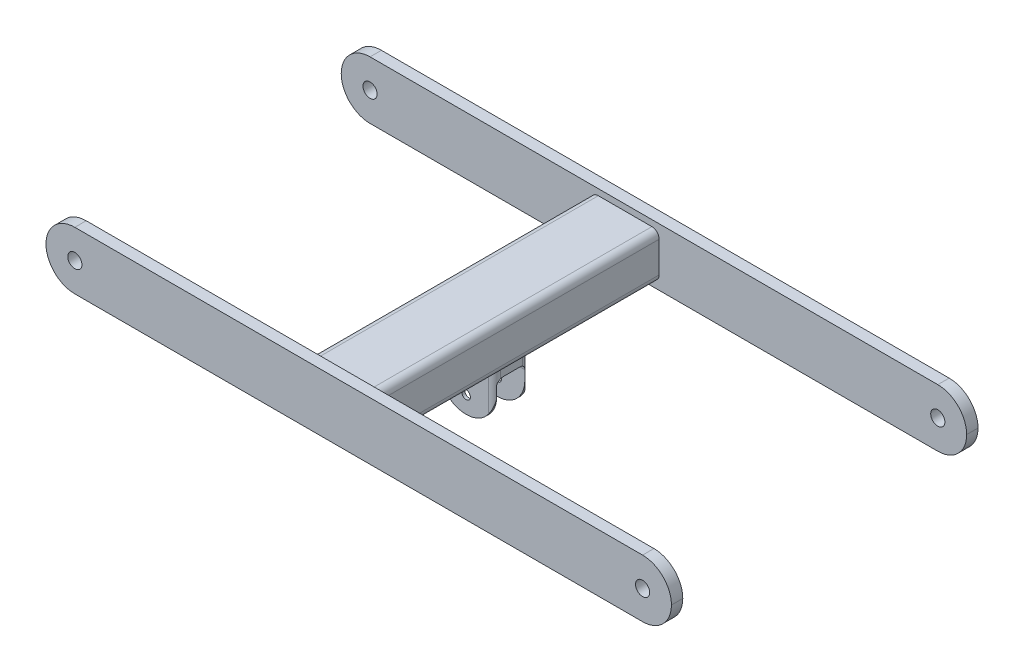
ISO-10303-21;
HEADER;
FILE_DESCRIPTION(('STEP AP214'),'2;1');
FILE_NAME('part.step','',(''),(''),'','','');
FILE_SCHEMA(('AUTOMOTIVE_DESIGN { 1 0 10303 214 1 1 1 1 }'));
ENDSEC;
DATA;
#1=APPLICATION_CONTEXT('core data for automotive mechanical design processes');
#2=APPLICATION_PROTOCOL_DEFINITION('international standard','automotive_design',2000,#1);
#3=PRODUCT_CONTEXT('',#1,'mechanical');
#4=PRODUCT('Part','Part','',(#3));
#5=PRODUCT_RELATED_PRODUCT_CATEGORY('part','',(#4));
#6=PRODUCT_DEFINITION_FORMATION('','',#4);
#7=PRODUCT_DEFINITION_CONTEXT('part definition',#1,'design');
#8=PRODUCT_DEFINITION('design','',#6,#7);
#9=PRODUCT_DEFINITION_SHAPE('','',#8);
#10=(LENGTH_UNIT() NAMED_UNIT(*) SI_UNIT(.MILLI.,.METRE.));
#11=(NAMED_UNIT(*) PLANE_ANGLE_UNIT() SI_UNIT($,.RADIAN.));
#12=(NAMED_UNIT(*) SI_UNIT($,.STERADIAN.) SOLID_ANGLE_UNIT());
#13=UNCERTAINTY_MEASURE_WITH_UNIT(LENGTH_MEASURE(1.E-05),#10,'distance_accuracy_value','');
#14=(GEOMETRIC_REPRESENTATION_CONTEXT(3) GLOBAL_UNCERTAINTY_ASSIGNED_CONTEXT((#13)) GLOBAL_UNIT_ASSIGNED_CONTEXT((#10,
#11,#12)) REPRESENTATION_CONTEXT('',''));
#15=CARTESIAN_POINT('',(0.,0.,0.));
#16=DIRECTION('',(0.,0.,1.));
#17=DIRECTION('',(1.,0.,0.));
#18=AXIS2_PLACEMENT_3D('',#15,#16,#17);
#19=CARTESIAN_POINT('',(230.2,-65.,9.79999999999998));
#20=DIRECTION('',(0.,1.,0.));
#21=DIRECTION('',(0.,0.,1.));
#22=AXIS2_PLACEMENT_3D('',#19,#20,#21);
#23=CYLINDRICAL_SURFACE('',#22,5.19999999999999);
#24=DIRECTION('',(0.,1.,0.));
#25=VECTOR('',#24,1.);
#26=CARTESIAN_POINT('',(225.696667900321,-65.,12.4000000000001));
#27=LINE('',#26,#25);
#28=CARTESIAN_POINT('',(225.696667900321,-32.5,12.4000000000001));
#29=VERTEX_POINT('',#28);
#30=CARTESIAN_POINT('',(225.696667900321,-40.6966679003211,12.4));
#31=VERTEX_POINT('',#30);
#32=EDGE_CURVE('E591',#29,#31,#27,.F.);
#33=ORIENTED_EDGE('',*,*,#32,.T.);
#34=CARTESIAN_POINT('',(225.696667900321,-40.6966679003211,12.4000000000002));
#35=CARTESIAN_POINT('',(225.696663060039,-40.8848214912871,12.3999479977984));
#36=CARTESIAN_POINT('',(225.69885269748,-41.0729593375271,12.4037835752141));
#37=CARTESIAN_POINT('',(225.70758268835,-41.4487747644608,12.418839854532));
#38=CARTESIAN_POINT('',(225.71412151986,-41.6364524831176,12.430057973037));
#39=CARTESIAN_POINT('',(225.73148566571,-42.0104900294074,12.4594457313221));
#40=CARTESIAN_POINT('',(225.74229808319,-42.1968521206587,12.477594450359));
#41=CARTESIAN_POINT('',(225.768147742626,-42.5685662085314,12.5201668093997));
#42=CARTESIAN_POINT('',(225.783185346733,-42.7539181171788,12.5445909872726));
#43=CARTESIAN_POINT('',(225.834583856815,-43.3086940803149,12.6261772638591));
#44=CARTESIAN_POINT('',(225.877207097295,-43.6763411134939,12.6916101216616));
#45=CARTESIAN_POINT('',(225.978658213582,-44.4065462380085,12.8377880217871));
#46=CARTESIAN_POINT('',(226.037501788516,-44.7690990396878,12.9185478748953));
#47=CARTESIAN_POINT('',(226.167753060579,-45.4712966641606,13.0850588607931));
#48=CARTESIAN_POINT('',(226.238398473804,-45.8111897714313,13.1703677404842));
#49=CARTESIAN_POINT('',(226.393905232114,-46.4866933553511,13.3450421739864));
#50=CARTESIAN_POINT('',(226.478768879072,-46.8223031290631,13.4344083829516));
#51=CARTESIAN_POINT('',(226.662756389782,-47.4896684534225,13.6137151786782));
#52=CARTESIAN_POINT('',(226.761888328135,-47.8214217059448,13.7036560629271));
#53=CARTESIAN_POINT('',(226.974442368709,-48.4809954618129,13.8810487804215));
#54=CARTESIAN_POINT('',(227.087866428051,-48.8088154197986,13.9685002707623));
#55=CARTESIAN_POINT('',(227.448733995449,-49.7835174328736,14.2223022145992));
#56=CARTESIAN_POINT('',(227.717641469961,-50.4247983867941,14.3810011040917));
#57=CARTESIAN_POINT('',(228.164205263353,-51.3724249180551,14.5877366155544));
#58=CARTESIAN_POINT('',(228.320165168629,-51.6857538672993,14.6514039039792));
#59=CARTESIAN_POINT('',(228.646539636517,-52.3072126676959,14.765544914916));
#60=CARTESIAN_POINT('',(228.816948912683,-52.6153443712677,14.8160234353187));
#61=CARTESIAN_POINT('',(229.087177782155,-53.079712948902,14.8804232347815));
#62=CARTESIAN_POINT('',(229.181815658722,-53.2381712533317,14.9002868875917));
#63=CARTESIAN_POINT('',(229.374917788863,-53.5532641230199,14.9350620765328));
#64=CARTESIAN_POINT('',(229.473381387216,-53.7098989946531,14.9499744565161));
#65=CARTESIAN_POINT('',(229.674391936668,-54.0216861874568,14.9743622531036));
#66=CARTESIAN_POINT('',(229.776951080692,-54.1768320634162,14.9838199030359));
#67=CARTESIAN_POINT('',(229.98575198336,-54.4849422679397,14.9966354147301));
#68=CARTESIAN_POINT('',(230.091994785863,-54.6379059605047,14.9999915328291));
#69=CARTESIAN_POINT('',(230.2,-54.7896431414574,15.));
#70=B_SPLINE_CURVE_WITH_KNOTS('',3,(#34,#35,#36,#37,#38,#39,#40,#41,#42,#43,#44,#45,#46,#47,#48,
#49,#50,#51,#52,#53,#54,#55,#56,#57,#58,#59,#60,#61,#62,#63,#64,#65,#66,#67,#68,#69),
.UNSPECIFIED.,.F.,.F.,(4,2,2,2,2,2,2,2,2,2,2,2,2,2,2,2,2,4),(0.,0.564383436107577,
1.12856948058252,1.69106576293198,2.25361027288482,3.38019418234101,4.50787232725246,
5.57996490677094,6.65223122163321,7.72510674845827,8.79812935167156,10.9340170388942,
12.0008181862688,13.0672307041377,13.624039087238,14.1807525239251,14.7392691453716,
15.2979453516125),.UNSPECIFIED.);
#71=CARTESIAN_POINT('',(230.2,-54.7896431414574,14.9999999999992));
#72=VERTEX_POINT('',#71);
#73=EDGE_CURVE('E411',#31,#72,#70,.T.);
#74=ORIENTED_EDGE('',*,*,#73,.T.);
#75=DIRECTION('',(0.,1.,0.));
#76=VECTOR('',#75,1.);
#77=CARTESIAN_POINT('',(230.2,-65.,15.));
#78=LINE('',#77,#76);
#79=CARTESIAN_POINT('',(230.2,0.,15.));
#80=VERTEX_POINT('',#79);
#81=EDGE_CURVE('E310',#72,#80,#78,.T.);
#82=ORIENTED_EDGE('',*,*,#81,.T.);
#83=CARTESIAN_POINT('',(230.2,0.,9.79999999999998));
#84=DIRECTION('',(0.,-1.,0.));
#85=DIRECTION('',(1.,0.,0.));
#86=AXIS2_PLACEMENT_3D('',#83,#84,#85);
#87=CIRCLE('',#86,5.19999999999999);
#88=CARTESIAN_POINT('',(225.,0.,9.79999999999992));
#89=VERTEX_POINT('',#88);
#90=EDGE_CURVE('E515',#80,#89,#87,.T.);
#91=ORIENTED_EDGE('',*,*,#90,.T.);
#92=DIRECTION('',(0.,1.,0.));
#93=VECTOR('',#92,1.);
#94=CARTESIAN_POINT('',(225.,-65.,9.79999999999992));
#95=LINE('',#94,#93);
#96=CARTESIAN_POINT('',(225.,-28.1136575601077,9.79999999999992));
#97=VERTEX_POINT('',#96);
#98=EDGE_CURVE('E286',#97,#89,#95,.T.);
#99=ORIENTED_EDGE('',*,*,#98,.F.);
#100=CARTESIAN_POINT('',(225.,-28.1136575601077,9.79999999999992));
#101=CARTESIAN_POINT('',(224.999984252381,-28.1777257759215,9.91714518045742));
#102=CARTESIAN_POINT('',(225.003957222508,-28.2464901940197,10.0316305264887));
#103=CARTESIAN_POINT('',(225.018688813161,-28.3926262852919,10.2543176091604));
#104=CARTESIAN_POINT('',(225.029438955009,-28.4699871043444,10.3625270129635));
#105=CARTESIAN_POINT('',(225.056454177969,-28.6321851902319,10.571339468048));
#106=CARTESIAN_POINT('',(225.072684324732,-28.71697263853,10.6719858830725));
#107=CARTESIAN_POINT('',(225.109453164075,-28.8937583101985,10.8658700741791));
#108=CARTESIAN_POINT('',(225.129993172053,-28.9857587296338,10.959105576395));
#109=CARTESIAN_POINT('',(225.196063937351,-29.2708336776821,11.2262231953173));
#110=CARTESIAN_POINT('',(225.246215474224,-29.4738598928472,11.3886396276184));
#111=CARTESIAN_POINT('',(225.323477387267,-29.7949401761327,11.6070817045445));
#112=CARTESIAN_POINT('',(225.349615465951,-29.9049197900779,11.675791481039));
#113=CARTESIAN_POINT('',(225.401394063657,-30.1300201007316,11.8045413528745));
#114=CARTESIAN_POINT('',(225.427034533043,-30.2451413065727,11.8645805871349));
#115=CARTESIAN_POINT('',(225.479094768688,-30.4917096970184,11.9811769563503));
#116=CARTESIAN_POINT('',(225.505337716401,-30.6236408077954,12.036791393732));
#117=CARTESIAN_POINT('',(225.554235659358,-30.8923292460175,12.1366570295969));
#118=CARTESIAN_POINT('',(225.576892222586,-31.0290844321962,12.1809131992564));
#119=CARTESIAN_POINT('',(225.617153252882,-31.3062064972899,12.2575164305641));
#120=CARTESIAN_POINT('',(225.634771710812,-31.4465621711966,12.2898965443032));
#121=CARTESIAN_POINT('',(225.663838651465,-31.7300945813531,12.3424693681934));
#122=CARTESIAN_POINT('',(225.675291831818,-31.8732690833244,12.3626713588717));
#123=CARTESIAN_POINT('',(225.6876967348,-32.0973654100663,12.3844136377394));
#124=CARTESIAN_POINT('',(225.691052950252,-32.1777632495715,12.3902564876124));
#125=CARTESIAN_POINT('',(225.695541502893,-32.3387693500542,12.398049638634));
#126=CARTESIAN_POINT('',(225.696674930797,-32.4193774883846,12.4000018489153));
#127=CARTESIAN_POINT('',(225.696667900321,-32.5,12.4));
#128=B_SPLINE_CURVE_WITH_KNOTS('',3,(#100,#101,#102,#103,#104,#105,#106,#107,#108,#109,#110,
#111,#112,#113,#114,#115,#116,#117,#118,#119,#120,#121,#122,#123,#124,#125,#126,#127),
.UNSPECIFIED.,.F.,.F.,(4,2,2,2,2,2,2,2,2,2,2,2,2,4),(0.,0.4002763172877,0.80005285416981,
1.19732752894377,1.59472363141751,2.38525773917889,2.78184122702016,3.17846407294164,
3.61459778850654,4.05054029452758,4.48526015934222,4.91964831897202,5.16157517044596,
5.40338327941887),.UNSPECIFIED.);
#129=EDGE_CURVE('E335',#97,#29,#128,.T.);
#130=ORIENTED_EDGE('',*,*,#129,.T.);
#131=EDGE_LOOP('',(#33,#74,#82,#91,#99,#130));
#132=FACE_BOUND('',#131,.T.);
#133=ADVANCED_FACE('F99',(#132),#23,.T.);
#134=CARTESIAN_POINT('',(225.,-65.,9.79999999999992));
#135=DIRECTION('',(1.,0.,0.));
#136=DIRECTION('',(0.,0.,-1.));
#137=AXIS2_PLACEMENT_3D('',#134,#135,#136);
#138=PLANE('',#137);
#139=DIRECTION('',(0.,1.,0.));
#140=VECTOR('',#139,1.);
#141=CARTESIAN_POINT('',(225.,-65.,-9.80000000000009));
#142=LINE('',#141,#140);
#143=CARTESIAN_POINT('',(225.,-28.1136575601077,-9.80000000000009));
#144=VERTEX_POINT('',#143);
#145=CARTESIAN_POINT('',(225.,0.,-9.80000000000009));
#146=VERTEX_POINT('',#145);
#147=EDGE_CURVE('E284',#144,#146,#142,.T.);
#148=ORIENTED_EDGE('',*,*,#147,.F.);
#149=CARTESIAN_POINT('',(225.,-32.5,-7.40000000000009));
#150=DIRECTION('',(1.,0.,0.));
#151=DIRECTION('',(0.,0.,-1.));
#152=AXIS2_PLACEMENT_3D('',#149,#150,#151);
#153=CIRCLE('',#152,5.);
#154=CARTESIAN_POINT('',(225.,-27.5,-7.40000000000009));
#155=VERTEX_POINT('',#154);
#156=EDGE_CURVE('E463',#144,#155,#153,.T.);
#157=ORIENTED_EDGE('',*,*,#156,.T.);
#158=DIRECTION('',(0.,0.,-1.));
#159=VECTOR('',#158,1.);
#160=CARTESIAN_POINT('',(225.,-27.5,12.4000000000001));
#161=LINE('',#160,#159);
#162=CARTESIAN_POINT('',(225.,-27.5,7.39999999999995));
#163=VERTEX_POINT('',#162);
#164=EDGE_CURVE('E583',#163,#155,#161,.T.);
#165=ORIENTED_EDGE('',*,*,#164,.F.);
#166=CARTESIAN_POINT('',(225.,-32.5,7.39999999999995));
#167=DIRECTION('',(1.,0.,0.));
#168=DIRECTION('',(0.,0.,-1.));
#169=AXIS2_PLACEMENT_3D('',#166,#167,#168);
#170=CIRCLE('',#169,5.);
#171=EDGE_CURVE('E332',#163,#97,#170,.T.);
#172=ORIENTED_EDGE('',*,*,#171,.T.);
#173=ORIENTED_EDGE('',*,*,#98,.T.);
#174=DIRECTION('',(0.,0.,-1.));
#175=VECTOR('',#174,1.);
#176=CARTESIAN_POINT('',(225.,0.,9.79999999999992));
#177=LINE('',#176,#175);
#178=EDGE_CURVE('E480',#89,#146,#177,.T.);
#179=ORIENTED_EDGE('',*,*,#178,.T.);
#180=EDGE_LOOP('',(#148,#157,#165,#172,#173,#179));
#181=FACE_BOUND('',#180,.T.);
#182=ADVANCED_FACE('F467',(#181),#138,.F.);
#183=CARTESIAN_POINT('',(230.2,-65.,-9.80000000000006));
#184=DIRECTION('',(0.,1.,0.));
#185=DIRECTION('',(0.,0.,1.));
#186=AXIS2_PLACEMENT_3D('',#183,#184,#185);
#187=CYLINDRICAL_SURFACE('',#186,5.20000000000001);
#188=DIRECTION('',(0.,1.,0.));
#189=VECTOR('',#188,1.);
#190=CARTESIAN_POINT('',(230.2,-65.,-15.0000000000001));
#191=LINE('',#190,#189);
#192=CARTESIAN_POINT('',(230.2,-54.7896431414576,-15.0000000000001));
#193=VERTEX_POINT('',#192);
#194=CARTESIAN_POINT('',(230.2,0.,-15.0000000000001));
#195=VERTEX_POINT('',#194);
#196=EDGE_CURVE('E266',#193,#195,#191,.T.);
#197=ORIENTED_EDGE('',*,*,#196,.F.);
#198=CARTESIAN_POINT('',(230.2,-54.7896431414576,-15.0000000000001));
#199=CARTESIAN_POINT('',(230.07665506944,-54.6163576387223,-14.9999857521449));
#200=CARTESIAN_POINT('',(229.955614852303,-54.4414779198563,-14.9956120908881));
#201=CARTESIAN_POINT('',(229.718366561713,-54.0889179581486,-14.9790154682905));
#202=CARTESIAN_POINT('',(229.602156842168,-53.911238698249,-14.9667952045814));
#203=CARTESIAN_POINT('',(229.374899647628,-53.5536507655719,-14.9354002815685));
#204=CARTESIAN_POINT('',(229.263843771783,-53.3737463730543,-14.9162374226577));
#205=CARTESIAN_POINT('',(229.046781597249,-53.0116651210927,-14.871721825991));
#206=CARTESIAN_POINT('',(228.940775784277,-52.8294880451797,-14.8463684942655));
#207=CARTESIAN_POINT('',(228.630420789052,-52.2798477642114,-14.7620971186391));
#208=CARTESIAN_POINT('',(228.433731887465,-51.9092720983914,-14.6949673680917));
#209=CARTESIAN_POINT('',(228.060987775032,-51.1612034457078,-14.543952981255));
#210=CARTESIAN_POINT('',(227.884941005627,-50.7837077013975,-14.460061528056));
#211=CARTESIAN_POINT('',(227.441915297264,-49.7667671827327,-14.2195409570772));
#212=CARTESIAN_POINT('',(227.193350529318,-49.1217985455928,-14.0519218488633));
#213=CARTESIAN_POINT('',(226.862840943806,-48.1426560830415,-13.7903873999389));
#214=CARTESIAN_POINT('',(226.759656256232,-47.8140368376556,-13.7014433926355));
#215=CARTESIAN_POINT('',(226.56736780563,-47.152843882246,-13.5230573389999));
#216=CARTESIAN_POINT('',(226.47826210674,-46.8202707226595,-13.4336153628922));
#217=CARTESIAN_POINT('',(226.314632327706,-46.1530906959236,-13.2580660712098));
#218=CARTESIAN_POINT('',(226.240018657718,-45.8185104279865,-13.1719410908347));
#219=CARTESIAN_POINT('',(226.104730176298,-45.1448222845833,-13.0062751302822));
#220=CARTESIAN_POINT('',(226.044058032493,-44.8057135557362,-12.9267354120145));
#221=CARTESIAN_POINT('',(225.93702441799,-44.1236266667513,-12.7791492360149));
#222=CARTESIAN_POINT('',(225.89062777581,-43.7806602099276,-12.7110747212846));
#223=CARTESIAN_POINT('',(225.812334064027,-43.0902580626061,-12.5916901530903));
#224=CARTESIAN_POINT('',(225.780427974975,-42.742825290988,-12.540369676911));
#225=CARTESIAN_POINT('',(225.74616013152,-42.2532738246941,-12.4839630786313));
#226=CARTESIAN_POINT('',(225.73754076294,-42.1126243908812,-12.4695814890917));
#227=CARTESIAN_POINT('',(225.722736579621,-41.8308347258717,-12.4446784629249));
#228=CARTESIAN_POINT('',(225.716552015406,-41.6896944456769,-12.4341574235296));
#229=CARTESIAN_POINT('',(225.706627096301,-41.4066613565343,-12.417193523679));
#230=CARTESIAN_POINT('',(225.702894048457,-41.264767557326,-12.4107628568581));
#231=CARTESIAN_POINT('',(225.697913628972,-40.9808065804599,-12.4021573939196));
#232=CARTESIAN_POINT('',(225.696666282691,-40.8387394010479,-12.3999826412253));
#233=CARTESIAN_POINT('',(225.696667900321,-40.696667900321,-12.4000000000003));
#234=B_SPLINE_CURVE_WITH_KNOTS('',3,(#198,#199,#200,#201,#202,#203,#204,#205,#206,#207,#208,
#209,#210,#211,#212,#213,#214,#215,#216,#217,#218,#219,#220,#221,#222,#223,#224,#225,#226,#227,
#228,#229,#230,#231,#232,#233),.UNSPECIFIED.,.F.,.F.,(4,2,2,2,2,2,2,2,2,2,2,2,2,2,2,2,2,4),(0.,
0.637985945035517,1.27575267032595,1.9124404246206,2.54918929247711,3.82267491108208,
5.09667950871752,7.22699606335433,8.29400727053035,9.36087163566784,10.4209146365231,
11.4811603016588,12.5387724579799,13.5957254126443,14.0206017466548,14.4455217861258,
14.8717026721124,15.2978879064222),.UNSPECIFIED.);
#235=CARTESIAN_POINT('',(225.696667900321,-40.6966679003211,-12.3999999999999));
#236=VERTEX_POINT('',#235);
#237=EDGE_CURVE('E271',#193,#236,#234,.T.);
#238=ORIENTED_EDGE('',*,*,#237,.T.);
#239=DIRECTION('',(0.,1.,0.));
#240=VECTOR('',#239,1.);
#241=CARTESIAN_POINT('',(225.696667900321,-65.,-12.4000000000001));
#242=LINE('',#241,#240);
#243=CARTESIAN_POINT('',(225.696667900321,-32.5,-12.4000000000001));
#244=VERTEX_POINT('',#243);
#245=EDGE_CURVE('E482',#236,#244,#242,.T.);
#246=ORIENTED_EDGE('',*,*,#245,.T.);
#247=CARTESIAN_POINT('',(225.696667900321,-32.5,-12.4000000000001));
#248=CARTESIAN_POINT('',(225.696733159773,-32.3663123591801,-12.4000242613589));
#249=CARTESIAN_POINT('',(225.693573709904,-32.2326569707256,-12.3946391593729));
#250=CARTESIAN_POINT('',(225.681298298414,-31.9665855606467,-12.373248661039));
#251=CARTESIAN_POINT('',(225.67218745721,-31.8341685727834,-12.3572523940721));
#252=CARTESIAN_POINT('',(225.648579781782,-31.572393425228,-12.3149791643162));
#253=CARTESIAN_POINT('',(225.634119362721,-31.4430207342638,-12.2887716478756));
#254=CARTESIAN_POINT('',(225.600674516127,-31.1873225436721,-12.2264085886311));
#255=CARTESIAN_POINT('',(225.581689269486,-31.060997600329,-12.1902512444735));
#256=CARTESIAN_POINT('',(225.519567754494,-30.6884583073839,-12.0675905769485));
#257=CARTESIAN_POINT('',(225.47115720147,-30.44763353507,-11.9667264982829));
#258=CARTESIAN_POINT('',(225.394914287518,-30.1009416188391,-11.7887968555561));
#259=CARTESIAN_POINT('',(225.368844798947,-29.9876093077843,-11.7249076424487));
#260=CARTESIAN_POINT('',(225.316691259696,-29.7662146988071,-11.5884722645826));
#261=CARTESIAN_POINT('',(225.290607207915,-29.6581528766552,-11.5159253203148));
#262=CARTESIAN_POINT('',(225.23735123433,-29.4383997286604,-11.3555954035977));
#263=CARTESIAN_POINT('',(225.21029154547,-29.3272520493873,-11.267029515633));
#264=CARTESIAN_POINT('',(225.159175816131,-29.1125512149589,-11.0804083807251));
#265=CARTESIAN_POINT('',(225.135118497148,-29.0089948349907,-10.9823572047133));
#266=CARTESIAN_POINT('',(225.091642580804,-28.81049981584,-10.7775525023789));
#267=CARTESIAN_POINT('',(225.072209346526,-28.7155345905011,-10.6708279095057));
#268=CARTESIAN_POINT('',(225.039459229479,-28.5347376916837,-10.4491183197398));
#269=CARTESIAN_POINT('',(225.02613725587,-28.448898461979,-10.3341402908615));
#270=CARTESIAN_POINT('',(225.011251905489,-28.3223702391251,-10.1484534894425));
#271=CARTESIAN_POINT('',(225.007094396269,-28.2782826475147,-10.0802420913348));
#272=CARTESIAN_POINT('',(225.001467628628,-28.1934380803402,-9.94167830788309));
#273=CARTESIAN_POINT('',(224.999998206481,-28.1526809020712,-9.87132605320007));
#274=CARTESIAN_POINT('',(225.,-28.1136575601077,-9.80000000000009));
#275=B_SPLINE_CURVE_WITH_KNOTS('',3,(#247,#248,#249,#250,#251,#252,#253,#254,#255,#256,#257,
#258,#259,#260,#261,#262,#263,#264,#265,#266,#267,#268,#269,#270,#271,#272,#273,#274),
.UNSPECIFIED.,.F.,.F.,(4,2,2,2,2,2,2,2,2,2,2,2,2,4),(0.,0.400864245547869,0.80138405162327,
1.19922619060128,1.59714040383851,2.38980998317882,2.78759245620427,3.18541077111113,
3.61890677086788,4.05221753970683,4.48413791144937,4.91569782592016,5.15954633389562,
5.40337998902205),.UNSPECIFIED.);
#276=EDGE_CURVE('E454',#244,#144,#275,.T.);
#277=ORIENTED_EDGE('',*,*,#276,.T.);
#278=ORIENTED_EDGE('',*,*,#147,.T.);
#279=CARTESIAN_POINT('',(230.2,0.,-9.80000000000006));
#280=DIRECTION('',(0.,-1.,0.));
#281=DIRECTION('',(1.,0.,0.));
#282=AXIS2_PLACEMENT_3D('',#279,#280,#281);
#283=CIRCLE('',#282,5.20000000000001);
#284=EDGE_CURVE('E282',#146,#195,#283,.T.);
#285=ORIENTED_EDGE('',*,*,#284,.T.);
#286=EDGE_LOOP('',(#197,#238,#246,#277,#278,#285));
#287=FACE_BOUND('',#286,.T.);
#288=ADVANCED_FACE('F280',(#287),#187,.T.);
#289=CARTESIAN_POINT('',(269.8,-65.,-14.9999999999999));
#290=DIRECTION('',(0.,0.,1.));
#291=DIRECTION('',(1.,0.,0.));
#292=AXIS2_PLACEMENT_3D('',#289,#290,#291);
#293=PLANE('',#292);
#294=CARTESIAN_POINT('',(250.,-50.,-15.));
#295=DIRECTION('',(0.,0.,1.));
#296=DIRECTION('',(1.,0.,0.));
#297=AXIS2_PLACEMENT_3D('',#294,#295,#296);
#298=CIRCLE('',#297,3.74999999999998);
#299=CARTESIAN_POINT('',(253.75,-50.,-15.));
#300=VERTEX_POINT('',#299);
#301=EDGE_CURVE('E631',#300,#300,#298,.T.);
#302=ORIENTED_EDGE('',*,*,#301,.T.);
#303=EDGE_LOOP('',(#302));
#304=FACE_BOUND('',#303,.T.);
#305=DIRECTION('',(0.,1.,0.));
#306=VECTOR('',#305,1.);
#307=CARTESIAN_POINT('',(269.8,-65.,-14.9999999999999));
#308=LINE('',#307,#306);
#309=CARTESIAN_POINT('',(269.8,-54.7896431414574,-14.9999999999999));
#310=VERTEX_POINT('',#309);
#311=CARTESIAN_POINT('',(269.8,0.,-14.9999999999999));
#312=VERTEX_POINT('',#311);
#313=EDGE_CURVE('E268',#310,#312,#308,.T.);
#314=ORIENTED_EDGE('',*,*,#313,.F.);
#315=CARTESIAN_POINT('',(250.,-40.6966679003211,-15.));
#316=DIRECTION('',(0.,0.,1.));
#317=DIRECTION('',(1.,0.,0.));
#318=AXIS2_PLACEMENT_3D('',#315,#316,#317);
#319=CIRCLE('',#318,24.3033320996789);
#320=EDGE_CURVE('E261',#193,#310,#319,.T.);
#321=ORIENTED_EDGE('',*,*,#320,.F.);
#322=ORIENTED_EDGE('',*,*,#196,.T.);
#323=DIRECTION('',(1.,0.,0.));
#324=VECTOR('',#323,1.);
#325=CARTESIAN_POINT('',(269.8,0.,-14.9999999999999));
#326=LINE('',#325,#324);
#327=EDGE_CURVE('E526',#195,#312,#326,.T.);
#328=ORIENTED_EDGE('',*,*,#327,.T.);
#329=EDGE_LOOP('',(#314,#321,#322,#328));
#330=FACE_BOUND('',#329,.T.);
#331=ADVANCED_FACE('F263',(#304,#330),#293,.F.);
#332=CARTESIAN_POINT('',(269.8,-65.,-9.79999999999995));
#333=DIRECTION('',(0.,1.,0.));
#334=DIRECTION('',(0.,0.,1.));
#335=AXIS2_PLACEMENT_3D('',#332,#333,#334);
#336=CYLINDRICAL_SURFACE('',#335,5.19999999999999);
#337=DIRECTION('',(0.,1.,0.));
#338=VECTOR('',#337,1.);
#339=CARTESIAN_POINT('',(274.303332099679,-65.,-12.3999999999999));
#340=LINE('',#339,#338);
#341=CARTESIAN_POINT('',(274.303332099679,-32.5,-12.3999999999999));
#342=VERTEX_POINT('',#341);
#343=CARTESIAN_POINT('',(274.303332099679,-40.6966679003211,-12.3999999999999));
#344=VERTEX_POINT('',#343);
#345=EDGE_CURVE('E584',#342,#344,#340,.F.);
#346=ORIENTED_EDGE('',*,*,#345,.T.);
#347=CARTESIAN_POINT('',(274.303332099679,-40.6966679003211,-12.4000000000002));
#348=CARTESIAN_POINT('',(274.303336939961,-40.8848214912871,-12.3999479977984));
#349=CARTESIAN_POINT('',(274.30114730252,-41.0729593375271,-12.4037835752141));
#350=CARTESIAN_POINT('',(274.29241731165,-41.4487747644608,-12.418839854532));
#351=CARTESIAN_POINT('',(274.28587848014,-41.6364524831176,-12.430057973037));
#352=CARTESIAN_POINT('',(274.26851433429,-42.0104900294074,-12.4594457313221));
#353=CARTESIAN_POINT('',(274.25770191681,-42.1968521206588,-12.477594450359));
#354=CARTESIAN_POINT('',(274.231852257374,-42.5685662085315,-12.5201668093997));
#355=CARTESIAN_POINT('',(274.216814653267,-42.7539181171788,-12.5445909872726));
#356=CARTESIAN_POINT('',(274.165416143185,-43.308694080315,-12.6261772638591));
#357=CARTESIAN_POINT('',(274.122792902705,-43.676341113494,-12.6916101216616));
#358=CARTESIAN_POINT('',(274.021341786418,-44.4065462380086,-12.8377880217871));
#359=CARTESIAN_POINT('',(273.962498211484,-44.7690990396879,-12.9185478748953));
#360=CARTESIAN_POINT('',(273.832246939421,-45.4712966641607,-13.0850588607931));
#361=CARTESIAN_POINT('',(273.761601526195,-45.8111897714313,-13.1703677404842));
#362=CARTESIAN_POINT('',(273.606094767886,-46.4866933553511,-13.3450421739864));
#363=CARTESIAN_POINT('',(273.521231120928,-46.8223031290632,-13.4344083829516));
#364=CARTESIAN_POINT('',(273.337243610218,-47.4896684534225,-13.6137151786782));
#365=CARTESIAN_POINT('',(273.238111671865,-47.8214217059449,-13.7036560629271));
#366=CARTESIAN_POINT('',(273.025557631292,-48.4809954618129,-13.8810487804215));
#367=CARTESIAN_POINT('',(272.912133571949,-48.8088154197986,-13.9685002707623));
#368=CARTESIAN_POINT('',(272.551266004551,-49.7835174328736,-14.2223022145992));
#369=CARTESIAN_POINT('',(272.282358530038,-50.4247983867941,-14.3810011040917));
#370=CARTESIAN_POINT('',(271.835794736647,-51.3724249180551,-14.5877366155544));
#371=CARTESIAN_POINT('',(271.679834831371,-51.6857538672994,-14.6514039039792));
#372=CARTESIAN_POINT('',(271.353460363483,-52.3072126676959,-14.765544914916));
#373=CARTESIAN_POINT('',(271.183051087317,-52.6153443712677,-14.8160234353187));
#374=CARTESIAN_POINT('',(270.912822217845,-53.079712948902,-14.8804232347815));
#375=CARTESIAN_POINT('',(270.818184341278,-53.2381712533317,-14.9002868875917));
#376=CARTESIAN_POINT('',(270.625082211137,-53.5532641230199,-14.9350620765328));
#377=CARTESIAN_POINT('',(270.526618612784,-53.709898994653,-14.9499744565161));
#378=CARTESIAN_POINT('',(270.325608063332,-54.0216861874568,-14.9743622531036));
#379=CARTESIAN_POINT('',(270.223048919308,-54.1768320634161,-14.9838199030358));
#380=CARTESIAN_POINT('',(270.01424801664,-54.4849422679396,-14.99663541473));
#381=CARTESIAN_POINT('',(269.908005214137,-54.6379059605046,-14.9999915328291));
#382=CARTESIAN_POINT('',(269.8,-54.7896431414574,-14.9999999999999));
#383=B_SPLINE_CURVE_WITH_KNOTS('',3,(#347,#348,#349,#350,#351,#352,#353,#354,#355,#356,#357,
#358,#359,#360,#361,#362,#363,#364,#365,#366,#367,#368,#369,#370,#371,#372,#373,#374,#375,#376,
#377,#378,#379,#380,#381,#382),.UNSPECIFIED.,.F.,.F.,(4,2,2,2,2,2,2,2,2,2,2,2,2,2,2,2,2,4),(0.,
0.564383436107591,1.12856948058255,1.69106576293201,2.25361027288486,3.38019418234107,
4.50787232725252,5.57996490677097,6.65223122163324,7.7251067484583,8.79812935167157,
10.9340170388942,12.0008181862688,13.0672307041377,13.624039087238,14.1807525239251,
14.7392691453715,15.2979453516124),.UNSPECIFIED.);
#384=EDGE_CURVE('E435',#344,#310,#383,.T.);
#385=ORIENTED_EDGE('',*,*,#384,.T.);
#386=ORIENTED_EDGE('',*,*,#313,.T.);
#387=CARTESIAN_POINT('',(269.8,0.,-9.79999999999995));
#388=DIRECTION('',(0.,-1.,0.));
#389=DIRECTION('',(1.,0.,0.));
#390=AXIS2_PLACEMENT_3D('',#387,#388,#389);
#391=CIRCLE('',#390,5.19999999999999);
#392=CARTESIAN_POINT('',(275.,0.,-9.79999999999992));
#393=VERTEX_POINT('',#392);
#394=EDGE_CURVE('E528',#312,#393,#391,.T.);
#395=ORIENTED_EDGE('',*,*,#394,.T.);
#396=DIRECTION('',(0.,1.,0.));
#397=VECTOR('',#396,1.);
#398=CARTESIAN_POINT('',(275.,-65.,-9.79999999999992));
#399=LINE('',#398,#397);
#400=CARTESIAN_POINT('',(275.,-28.1136575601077,-9.79999999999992));
#401=VERTEX_POINT('',#400);
#402=EDGE_CURVE('E288',#401,#393,#399,.T.);
#403=ORIENTED_EDGE('',*,*,#402,.F.);
#404=CARTESIAN_POINT('',(275.,-28.1136575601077,-9.79999999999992));
#405=CARTESIAN_POINT('',(275.000015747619,-28.1777257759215,-9.91714518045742));
#406=CARTESIAN_POINT('',(274.996042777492,-28.2464901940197,-10.0316305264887));
#407=CARTESIAN_POINT('',(274.981311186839,-28.3926262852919,-10.2543176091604));
#408=CARTESIAN_POINT('',(274.970561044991,-28.4699871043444,-10.3625270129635));
#409=CARTESIAN_POINT('',(274.943545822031,-28.632185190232,-10.571339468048));
#410=CARTESIAN_POINT('',(274.927315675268,-28.7169726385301,-10.6719858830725));
#411=CARTESIAN_POINT('',(274.890546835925,-28.8937583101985,-10.8658700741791));
#412=CARTESIAN_POINT('',(274.870006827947,-28.9857587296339,-10.959105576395));
#413=CARTESIAN_POINT('',(274.803936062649,-29.2708336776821,-11.2262231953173));
#414=CARTESIAN_POINT('',(274.753784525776,-29.4738598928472,-11.3886396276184));
#415=CARTESIAN_POINT('',(274.676522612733,-29.7949401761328,-11.6070817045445));
#416=CARTESIAN_POINT('',(274.650384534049,-29.904919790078,-11.675791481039));
#417=CARTESIAN_POINT('',(274.598605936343,-30.1300201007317,-11.8045413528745));
#418=CARTESIAN_POINT('',(274.572965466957,-30.2451413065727,-11.8645805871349));
#419=CARTESIAN_POINT('',(274.520905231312,-30.4917096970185,-11.9811769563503));
#420=CARTESIAN_POINT('',(274.494662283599,-30.6236408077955,-12.036791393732));
#421=CARTESIAN_POINT('',(274.445764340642,-30.8923292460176,-12.1366570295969));
#422=CARTESIAN_POINT('',(274.423107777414,-31.0290844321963,-12.1809131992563));
#423=CARTESIAN_POINT('',(274.382846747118,-31.3062064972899,-12.257516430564));
#424=CARTESIAN_POINT('',(274.365228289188,-31.4465621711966,-12.2898965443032));
#425=CARTESIAN_POINT('',(274.336161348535,-31.7300945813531,-12.3424693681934));
#426=CARTESIAN_POINT('',(274.324708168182,-31.8732690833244,-12.3626713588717));
#427=CARTESIAN_POINT('',(274.3123032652,-32.0973654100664,-12.3844136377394));
#428=CARTESIAN_POINT('',(274.308947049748,-32.1777632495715,-12.3902564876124));
#429=CARTESIAN_POINT('',(274.304458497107,-32.3387693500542,-12.398049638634));
#430=CARTESIAN_POINT('',(274.303325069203,-32.4193774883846,-12.4000018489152));
#431=CARTESIAN_POINT('',(274.303332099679,-32.5,-12.3999999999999));
#432=B_SPLINE_CURVE_WITH_KNOTS('',3,(#404,#405,#406,#407,#408,#409,#410,#411,#412,#413,#414,
#415,#416,#417,#418,#419,#420,#421,#422,#423,#424,#425,#426,#427,#428,#429,#430,#431),
.UNSPECIFIED.,.F.,.F.,(4,2,2,2,2,2,2,2,2,2,2,2,2,4),(0.,0.400276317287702,0.800052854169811,
1.19732752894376,1.59472363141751,2.3852577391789,2.78184122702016,3.17846407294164,
3.61459778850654,4.05054029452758,4.48526015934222,4.91964831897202,5.16157517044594,
5.40338327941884),.UNSPECIFIED.);
#433=EDGE_CURVE('E447',#401,#342,#432,.T.);
#434=ORIENTED_EDGE('',*,*,#433,.T.);
#435=EDGE_LOOP('',(#346,#385,#386,#395,#403,#434));
#436=FACE_BOUND('',#435,.T.);
#437=ADVANCED_FACE('F440',(#436),#336,.T.);
#438=CARTESIAN_POINT('',(275.,-65.,-9.79999999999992));
#439=DIRECTION('',(-1.,0.,0.));
#440=DIRECTION('',(0.,0.,1.));
#441=AXIS2_PLACEMENT_3D('',#438,#439,#440);
#442=PLANE('',#441);
#443=DIRECTION('',(0.,1.,0.));
#444=VECTOR('',#443,1.);
#445=CARTESIAN_POINT('',(275.,-65.,9.80000000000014));
#446=LINE('',#445,#444);
#447=CARTESIAN_POINT('',(275.,-28.1136575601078,9.80000000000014));
#448=VERTEX_POINT('',#447);
#449=CARTESIAN_POINT('',(275.,0.,9.80000000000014));
#450=VERTEX_POINT('',#449);
#451=EDGE_CURVE('E542',#448,#450,#446,.T.);
#452=ORIENTED_EDGE('',*,*,#451,.F.);
#453=CARTESIAN_POINT('',(275.,-32.5,7.40000000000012));
#454=DIRECTION('',(-1.,0.,0.));
#455=DIRECTION('',(0.,0.,1.));
#456=AXIS2_PLACEMENT_3D('',#453,#454,#455);
#457=CIRCLE('',#456,5.);
#458=CARTESIAN_POINT('',(275.,-27.5,7.40000000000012));
#459=VERTEX_POINT('',#458);
#460=EDGE_CURVE('E388',#448,#459,#457,.T.);
#461=ORIENTED_EDGE('',*,*,#460,.T.);
#462=DIRECTION('',(0.,0.,-1.));
#463=VECTOR('',#462,1.);
#464=CARTESIAN_POINT('',(275.,-27.5,-9.79999999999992));
#465=LINE('',#464,#463);
#466=CARTESIAN_POINT('',(275.,-27.5,-7.39999999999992));
#467=VERTEX_POINT('',#466);
#468=EDGE_CURVE('E511',#459,#467,#465,.T.);
#469=ORIENTED_EDGE('',*,*,#468,.T.);
#470=CARTESIAN_POINT('',(275.,-32.5,-7.39999999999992));
#471=DIRECTION('',(-1.,0.,0.));
#472=DIRECTION('',(0.,0.,1.));
#473=AXIS2_PLACEMENT_3D('',#470,#471,#472);
#474=CIRCLE('',#473,5.);
#475=EDGE_CURVE('E455',#467,#401,#474,.T.);
#476=ORIENTED_EDGE('',*,*,#475,.T.);
#477=ORIENTED_EDGE('',*,*,#402,.T.);
#478=DIRECTION('',(0.,0.,1.));
#479=VECTOR('',#478,1.);
#480=CARTESIAN_POINT('',(275.,0.,-9.79999999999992));
#481=LINE('',#480,#479);
#482=EDGE_CURVE('E531',#393,#450,#481,.T.);
#483=ORIENTED_EDGE('',*,*,#482,.T.);
#484=EDGE_LOOP('',(#452,#461,#469,#476,#477,#483));
#485=FACE_BOUND('',#484,.T.);
#486=ADVANCED_FACE('F395',(#485),#442,.F.);
#487=CARTESIAN_POINT('',(269.8,-65.,9.80000000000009));
#488=DIRECTION('',(0.,1.,0.));
#489=DIRECTION('',(0.,0.,1.));
#490=AXIS2_PLACEMENT_3D('',#487,#488,#489);
#491=CYLINDRICAL_SURFACE('',#490,5.19999999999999);
#492=DIRECTION('',(0.,1.,0.));
#493=VECTOR('',#492,1.);
#494=CARTESIAN_POINT('',(269.8,-65.,15.0000000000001));
#495=LINE('',#494,#493);
#496=CARTESIAN_POINT('',(269.8,-54.7896431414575,15.0000000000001));
#497=VERTEX_POINT('',#496);
#498=CARTESIAN_POINT('',(269.8,0.,15.0000000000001));
#499=VERTEX_POINT('',#498);
#500=EDGE_CURVE('E540',#497,#499,#495,.T.);
#501=ORIENTED_EDGE('',*,*,#500,.F.);
#502=CARTESIAN_POINT('',(269.8,-54.7896431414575,15.0000000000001));
#503=CARTESIAN_POINT('',(269.92334493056,-54.6163576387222,14.999985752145));
#504=CARTESIAN_POINT('',(270.044385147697,-54.4414779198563,14.9956120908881));
#505=CARTESIAN_POINT('',(270.281633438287,-54.0889179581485,14.9790154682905));
#506=CARTESIAN_POINT('',(270.397843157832,-53.9112386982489,14.9667952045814));
#507=CARTESIAN_POINT('',(270.625100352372,-53.5536507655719,14.9354002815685));
#508=CARTESIAN_POINT('',(270.736156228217,-53.3737463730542,14.9162374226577));
#509=CARTESIAN_POINT('',(270.953218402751,-53.0116651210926,14.871721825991));
#510=CARTESIAN_POINT('',(271.059224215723,-52.8294880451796,14.8463684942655));
#511=CARTESIAN_POINT('',(271.369579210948,-52.2798477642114,14.7620971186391));
#512=CARTESIAN_POINT('',(271.566268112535,-51.9092720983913,14.6949673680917));
#513=CARTESIAN_POINT('',(271.939012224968,-51.1612034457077,14.543952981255));
#514=CARTESIAN_POINT('',(272.115058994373,-50.7837077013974,14.460061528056));
#515=CARTESIAN_POINT('',(272.558084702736,-49.7667671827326,14.2195409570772));
#516=CARTESIAN_POINT('',(272.806649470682,-49.1217985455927,14.0519218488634));
#517=CARTESIAN_POINT('',(273.137159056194,-48.1426560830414,13.7903873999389));
#518=CARTESIAN_POINT('',(273.240343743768,-47.8140368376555,13.7014433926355));
#519=CARTESIAN_POINT('',(273.43263219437,-47.1528438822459,13.5230573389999));
#520=CARTESIAN_POINT('',(273.52173789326,-46.8202707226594,13.4336153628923));
#521=CARTESIAN_POINT('',(273.685367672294,-46.1530906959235,13.2580660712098));
#522=CARTESIAN_POINT('',(273.759981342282,-45.8185104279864,13.1719410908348));
#523=CARTESIAN_POINT('',(273.895269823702,-45.1448222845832,13.0062751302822));
#524=CARTESIAN_POINT('',(273.955941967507,-44.8057135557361,12.9267354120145));
#525=CARTESIAN_POINT('',(274.06297558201,-44.1236266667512,12.779149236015));
#526=CARTESIAN_POINT('',(274.10937222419,-43.7806602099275,12.7110747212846));
#527=CARTESIAN_POINT('',(274.187665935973,-43.0902580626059,12.5916901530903));
#528=CARTESIAN_POINT('',(274.219572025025,-42.7428252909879,12.540369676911));
#529=CARTESIAN_POINT('',(274.25383986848,-42.253273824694,12.4839630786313));
#530=CARTESIAN_POINT('',(274.26245923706,-42.1126243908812,12.4695814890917));
#531=CARTESIAN_POINT('',(274.277263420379,-41.8308347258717,12.4446784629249));
#532=CARTESIAN_POINT('',(274.283447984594,-41.6896944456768,12.4341574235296));
#533=CARTESIAN_POINT('',(274.293372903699,-41.4066613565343,12.4171935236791));
#534=CARTESIAN_POINT('',(274.297105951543,-41.264767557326,12.4107628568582));
#535=CARTESIAN_POINT('',(274.302086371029,-40.9808065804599,12.4021573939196));
#536=CARTESIAN_POINT('',(274.303333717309,-40.8387394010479,12.3999826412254));
#537=CARTESIAN_POINT('',(274.303332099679,-40.696667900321,12.4000000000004));
#538=B_SPLINE_CURVE_WITH_KNOTS('',3,(#502,#503,#504,#505,#506,#507,#508,#509,#510,#511,#512,
#513,#514,#515,#516,#517,#518,#519,#520,#521,#522,#523,#524,#525,#526,#527,#528,#529,#530,#531,
#532,#533,#534,#535,#536,#537),.UNSPECIFIED.,.F.,.F.,(4,2,2,2,2,2,2,2,2,2,2,2,2,2,2,2,2,4),(0.,
0.637985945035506,1.27575267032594,1.91244042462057,2.54918929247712,3.82267491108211,
5.09667950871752,7.22699606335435,8.29400727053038,9.36087163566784,10.4209146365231,
11.4811603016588,12.5387724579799,13.5957254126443,14.0206017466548,14.4455217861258,
14.8717026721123,15.2978879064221),.UNSPECIFIED.);
#539=CARTESIAN_POINT('',(274.303332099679,-40.6966679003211,12.4));
#540=VERTEX_POINT('',#539);
#541=EDGE_CURVE('E402',#497,#540,#538,.T.);
#542=ORIENTED_EDGE('',*,*,#541,.T.);
#543=DIRECTION('',(0.,1.,0.));
#544=VECTOR('',#543,1.);
#545=CARTESIAN_POINT('',(274.303332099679,-65.,12.4000000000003));
#546=LINE('',#545,#544);
#547=CARTESIAN_POINT('',(274.303332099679,-32.5,12.4000000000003));
#548=VERTEX_POINT('',#547);
#549=EDGE_CURVE('E589',#540,#548,#546,.T.);
#550=ORIENTED_EDGE('',*,*,#549,.T.);
#551=CARTESIAN_POINT('',(274.303332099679,-32.5,12.4000000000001));
#552=CARTESIAN_POINT('',(274.303266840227,-32.3663123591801,12.400024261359));
#553=CARTESIAN_POINT('',(274.306426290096,-32.2326569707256,12.3946391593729));
#554=CARTESIAN_POINT('',(274.318701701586,-31.9665855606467,12.3732486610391));
#555=CARTESIAN_POINT('',(274.32781254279,-31.8341685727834,12.3572523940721));
#556=CARTESIAN_POINT('',(274.351420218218,-31.572393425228,12.3149791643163));
#557=CARTESIAN_POINT('',(274.365880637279,-31.4430207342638,12.2887716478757));
#558=CARTESIAN_POINT('',(274.399325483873,-31.1873225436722,12.2264085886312));
#559=CARTESIAN_POINT('',(274.418310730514,-31.060997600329,12.1902512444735));
#560=CARTESIAN_POINT('',(274.480432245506,-30.6884583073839,12.0675905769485));
#561=CARTESIAN_POINT('',(274.52884279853,-30.44763353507,11.9667264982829));
#562=CARTESIAN_POINT('',(274.605085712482,-30.1009416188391,11.7887968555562));
#563=CARTESIAN_POINT('',(274.631155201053,-29.9876093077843,11.7249076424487));
#564=CARTESIAN_POINT('',(274.683308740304,-29.7662146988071,11.5884722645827));
#565=CARTESIAN_POINT('',(274.709392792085,-29.6581528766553,11.5159253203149));
#566=CARTESIAN_POINT('',(274.76264876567,-29.4383997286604,11.3555954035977));
#567=CARTESIAN_POINT('',(274.78970845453,-29.3272520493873,11.2670295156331));
#568=CARTESIAN_POINT('',(274.840824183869,-29.1125512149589,11.0804083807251));
#569=CARTESIAN_POINT('',(274.864881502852,-29.0089948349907,10.9823572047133));
#570=CARTESIAN_POINT('',(274.908357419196,-28.81049981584,10.7775525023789));
#571=CARTESIAN_POINT('',(274.927790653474,-28.7155345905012,10.6708279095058));
#572=CARTESIAN_POINT('',(274.960540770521,-28.5347376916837,10.4491183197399));
#573=CARTESIAN_POINT('',(274.97386274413,-28.4488984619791,10.3341402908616));
#574=CARTESIAN_POINT('',(274.988748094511,-28.3223702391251,10.1484534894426));
#575=CARTESIAN_POINT('',(274.992905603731,-28.2782826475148,10.0802420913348));
#576=CARTESIAN_POINT('',(274.998532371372,-28.1934380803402,9.94167830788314));
#577=CARTESIAN_POINT('',(275.000001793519,-28.1526809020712,9.87132605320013));
#578=CARTESIAN_POINT('',(275.,-28.1136575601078,9.80000000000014));
#579=B_SPLINE_CURVE_WITH_KNOTS('',3,(#551,#552,#553,#554,#555,#556,#557,#558,#559,#560,#561,
#562,#563,#564,#565,#566,#567,#568,#569,#570,#571,#572,#573,#574,#575,#576,#577,#578),
.UNSPECIFIED.,.F.,.F.,(4,2,2,2,2,2,2,2,2,2,2,2,2,4),(0.,0.400864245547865,0.801384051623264,
1.19922619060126,1.59714040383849,2.3898099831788,2.78759245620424,3.1854107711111,
3.61890677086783,4.05221753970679,4.48413791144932,4.91569782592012,5.15954633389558,
5.40337998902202),.UNSPECIFIED.);
#580=EDGE_CURVE('E380',#548,#448,#579,.T.);
#581=ORIENTED_EDGE('',*,*,#580,.T.);
#582=ORIENTED_EDGE('',*,*,#451,.T.);
#583=CARTESIAN_POINT('',(269.8,0.,9.80000000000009));
#584=DIRECTION('',(0.,-1.,0.));
#585=DIRECTION('',(1.,0.,0.));
#586=AXIS2_PLACEMENT_3D('',#583,#584,#585);
#587=CIRCLE('',#586,5.19999999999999);
#588=EDGE_CURVE('E534',#450,#499,#587,.T.);
#589=ORIENTED_EDGE('',*,*,#588,.T.);
#590=EDGE_LOOP('',(#501,#542,#550,#581,#582,#589));
#591=FACE_BOUND('',#590,.T.);
#592=ADVANCED_FACE('F390',(#591),#491,.T.);
#593=CARTESIAN_POINT('',(230.2,-65.,-9.80000000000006));
#594=DIRECTION('',(0.,1.,0.));
#595=DIRECTION('',(0.,0.,1.));
#596=AXIS2_PLACEMENT_3D('',#593,#594,#595);
#597=CYLINDRICAL_SURFACE('',#596,2.6);
#598=DIRECTION('',(0.,1.,0.));
#599=VECTOR('',#598,1.);
#600=CARTESIAN_POINT('',(227.6,-65.,-9.80000000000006));
#601=LINE('',#600,#599);
#602=CARTESIAN_POINT('',(227.6,-28.1136575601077,-9.80000000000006));
#603=VERTEX_POINT('',#602);
#604=CARTESIAN_POINT('',(227.6,0.,-9.80000000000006));
#605=VERTEX_POINT('',#604);
#606=EDGE_CURVE('E123',#603,#605,#601,.T.);
#607=ORIENTED_EDGE('',*,*,#606,.F.);
#608=CARTESIAN_POINT('',(227.6,-28.1136575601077,-9.80000000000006));
#609=CARTESIAN_POINT('',(227.599996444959,-28.1585951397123,-9.88217193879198));
#610=CARTESIAN_POINT('',(227.603893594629,-28.2058434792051,-9.96300271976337));
#611=CARTESIAN_POINT('',(227.618708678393,-28.3043918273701,-10.1213038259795));
#612=CARTESIAN_POINT('',(227.629614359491,-28.3556846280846,-10.1987797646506));
#613=CARTESIAN_POINT('',(227.65752779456,-28.461369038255,-10.3492103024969));
#614=CARTESIAN_POINT('',(227.674472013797,-28.5157235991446,-10.4222030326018));
#615=CARTESIAN_POINT('',(227.713769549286,-28.6275795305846,-10.5642591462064));
#616=CARTESIAN_POINT('',(227.736125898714,-28.685082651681,-10.6333202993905));
#617=CARTESIAN_POINT('',(227.793175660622,-28.8208912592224,-10.7878821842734));
#618=CARTESIAN_POINT('',(227.829549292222,-28.9001614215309,-10.87191727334));
#619=CARTESIAN_POINT('',(227.909074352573,-29.0625480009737,-11.0327671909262));
#620=CARTESIAN_POINT('',(227.952228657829,-29.1456660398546,-11.1095789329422));
#621=CARTESIAN_POINT('',(228.044411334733,-29.3154838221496,-11.2563604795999));
#622=CARTESIAN_POINT('',(228.093468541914,-29.4021996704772,-11.3262933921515));
#623=CARTESIAN_POINT('',(228.1962925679,-29.5782085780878,-11.4589752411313));
#624=CARTESIAN_POINT('',(228.250057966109,-29.6675008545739,-11.521726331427));
#625=CARTESIAN_POINT('',(228.384261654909,-29.8851356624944,-11.6644633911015));
#626=CARTESIAN_POINT('',(228.466629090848,-30.0145400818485,-11.7410286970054));
#627=CARTESIAN_POINT('',(228.637299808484,-30.2765785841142,-11.8809006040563));
#628=CARTESIAN_POINT('',(228.725605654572,-30.4092140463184,-11.9442014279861));
#629=CARTESIAN_POINT('',(228.906627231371,-30.6767975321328,-12.0580099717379));
#630=CARTESIAN_POINT('',(228.999340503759,-30.811744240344,-12.1085247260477));
#631=CARTESIAN_POINT('',(229.187998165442,-31.0833205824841,-12.1972302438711));
#632=CARTESIAN_POINT('',(229.283941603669,-31.2199497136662,-12.2354246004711));
#633=CARTESIAN_POINT('',(229.513473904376,-31.5444226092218,-12.3116065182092));
#634=CARTESIAN_POINT('',(229.648043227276,-31.7327901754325,-12.3444492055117));
#635=CARTESIAN_POINT('',(229.919006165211,-32.1103150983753,-12.3884051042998));
#636=CARTESIAN_POINT('',(230.055396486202,-32.2994706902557,-12.3995532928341));
#637=CARTESIAN_POINT('',(230.194485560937,-32.4923528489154,-12.3999956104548));
#638=CARTESIAN_POINT('',(230.197242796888,-32.4961764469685,-12.3999999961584));
#639=CARTESIAN_POINT('',(230.2,-32.5,-12.4000000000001));
#640=B_SPLINE_CURVE_WITH_KNOTS('',3,(#608,#609,#610,#611,#612,#613,#614,#615,#616,#617,#618,
#619,#620,#621,#622,#623,#624,#625,#626,#627,#628,#629,#630,#631,#632,#633,#634,#635,#636,#637,
#638,#639),.UNSPECIFIED.,.F.,.F.,(4,2,2,2,2,2,2,2,2,2,2,2,2,2,2,4),(0.,0.280753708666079,
0.561017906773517,0.838416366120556,1.11597065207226,1.47877309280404,1.84172985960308,
2.20653772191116,2.57123588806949,3.0848027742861,3.5985928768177,4.11209969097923,
4.62545661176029,5.32584032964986,6.02509391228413,6.03923605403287),.UNSPECIFIED.);
#641=CARTESIAN_POINT('',(230.2,-32.5,-12.4000000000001));
#642=VERTEX_POINT('',#641);
#643=EDGE_CURVE('E13',#603,#642,#640,.T.);
#644=ORIENTED_EDGE('',*,*,#643,.T.);
#645=DIRECTION('',(0.,1.,0.));
#646=VECTOR('',#645,1.);
#647=CARTESIAN_POINT('',(230.2,-65.,-12.4000000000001));
#648=LINE('',#647,#646);
#649=CARTESIAN_POINT('',(230.2,0.,-12.4000000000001));
#650=VERTEX_POINT('',#649);
#651=EDGE_CURVE('E294',#642,#650,#648,.T.);
#652=ORIENTED_EDGE('',*,*,#651,.T.);
#653=CARTESIAN_POINT('',(230.2,0.,-9.80000000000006));
#654=DIRECTION('',(0.,-1.,0.));
#655=DIRECTION('',(1.,0.,0.));
#656=AXIS2_PLACEMENT_3D('',#653,#654,#655);
#657=CIRCLE('',#656,2.6);
#658=EDGE_CURVE('E499',#605,#650,#657,.T.);
#659=ORIENTED_EDGE('',*,*,#658,.F.);
#660=EDGE_LOOP('',(#607,#644,#652,#659));
#661=FACE_BOUND('',#660,.T.);
#662=ADVANCED_FACE('F361',(#661),#597,.F.);
#663=CARTESIAN_POINT('',(227.6,-65.,9.79999999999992));
#664=DIRECTION('',(1.,0.,0.));
#665=DIRECTION('',(0.,0.,-1.));
#666=AXIS2_PLACEMENT_3D('',#663,#664,#665);
#667=PLANE('',#666);
#668=DIRECTION('',(0.,0.,1.));
#669=VECTOR('',#668,1.);
#670=CARTESIAN_POINT('',(227.6,-27.5,9.79999999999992));
#671=LINE('',#670,#669);
#672=CARTESIAN_POINT('',(227.6,-27.5,-7.40000000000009));
#673=VERTEX_POINT('',#672);
#674=CARTESIAN_POINT('',(227.6,-27.5,7.39999999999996));
#675=VERTEX_POINT('',#674);
#676=EDGE_CURVE('E497',#673,#675,#671,.T.);
#677=ORIENTED_EDGE('',*,*,#676,.F.);
#678=CARTESIAN_POINT('',(227.6,-32.5,-7.40000000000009));
#679=DIRECTION('',(1.,0.,0.));
#680=DIRECTION('',(0.,0.,-1.));
#681=AXIS2_PLACEMENT_3D('',#678,#679,#680);
#682=CIRCLE('',#681,5.);
#683=EDGE_CURVE('E109',#673,#603,#682,.F.);
#684=ORIENTED_EDGE('',*,*,#683,.T.);
#685=ORIENTED_EDGE('',*,*,#606,.T.);
#686=DIRECTION('',(0.,0.,-1.));
#687=VECTOR('',#686,1.);
#688=CARTESIAN_POINT('',(227.6,0.,9.79999999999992));
#689=LINE('',#688,#687);
#690=CARTESIAN_POINT('',(227.6,0.,9.79999999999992));
#691=VERTEX_POINT('',#690);
#692=EDGE_CURVE('E510',#691,#605,#689,.T.);
#693=ORIENTED_EDGE('',*,*,#692,.F.);
#694=DIRECTION('',(0.,1.,0.));
#695=VECTOR('',#694,1.);
#696=CARTESIAN_POINT('',(227.6,-65.,9.79999999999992));
#697=LINE('',#696,#695);
#698=CARTESIAN_POINT('',(227.6,-28.1136575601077,9.79999999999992));
#699=VERTEX_POINT('',#698);
#700=EDGE_CURVE('E307',#699,#691,#697,.T.);
#701=ORIENTED_EDGE('',*,*,#700,.F.);
#702=CARTESIAN_POINT('',(227.6,-32.5,7.39999999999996));
#703=DIRECTION('',(1.,0.,0.));
#704=DIRECTION('',(0.,0.,-1.));
#705=AXIS2_PLACEMENT_3D('',#702,#703,#704);
#706=CIRCLE('',#705,5.);
#707=EDGE_CURVE('E572',#699,#675,#706,.F.);
#708=ORIENTED_EDGE('',*,*,#707,.T.);
#709=EDGE_LOOP('',(#677,#684,#685,#693,#701,#708));
#710=FACE_BOUND('',#709,.T.);
#711=ADVANCED_FACE('F494',(#710),#667,.T.);
#712=CARTESIAN_POINT('',(230.2,-65.,9.79999999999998));
#713=DIRECTION('',(0.,1.,0.));
#714=DIRECTION('',(0.,0.,1.));
#715=AXIS2_PLACEMENT_3D('',#712,#713,#714);
#716=CYLINDRICAL_SURFACE('',#715,2.6);
#717=DIRECTION('',(0.,1.,0.));
#718=VECTOR('',#717,1.);
#719=CARTESIAN_POINT('',(230.2,-65.,12.4));
#720=LINE('',#719,#718);
#721=CARTESIAN_POINT('',(230.2,-32.5,12.4));
#722=VERTEX_POINT('',#721);
#723=CARTESIAN_POINT('',(230.2,0.,12.4));
#724=VERTEX_POINT('',#723);
#725=EDGE_CURVE('E305',#722,#724,#720,.T.);
#726=ORIENTED_EDGE('',*,*,#725,.F.);
#727=CARTESIAN_POINT('',(227.6,-28.1136575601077,9.79999999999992));
#728=CARTESIAN_POINT('',(227.599996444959,-28.1585951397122,9.88217193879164));
#729=CARTESIAN_POINT('',(227.603893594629,-28.2058434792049,9.96300271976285));
#730=CARTESIAN_POINT('',(227.618708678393,-28.3043918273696,10.1213038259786));
#731=CARTESIAN_POINT('',(227.629614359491,-28.355684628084,10.1987797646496));
#732=CARTESIAN_POINT('',(227.65752779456,-28.4613690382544,10.3492103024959));
#733=CARTESIAN_POINT('',(227.674472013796,-28.5157235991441,10.422203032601));
#734=CARTESIAN_POINT('',(227.713769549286,-28.6275795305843,10.5642591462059));
#735=CARTESIAN_POINT('',(227.736125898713,-28.6850826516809,10.6333202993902));
#736=CARTESIAN_POINT('',(227.793175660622,-28.8208912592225,10.7878821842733));
#737=CARTESIAN_POINT('',(227.829549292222,-28.9001614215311,10.8719172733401));
#738=CARTESIAN_POINT('',(227.909074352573,-29.0625480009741,11.0327671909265));
#739=CARTESIAN_POINT('',(227.95222865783,-29.1456660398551,11.1095789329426));
#740=CARTESIAN_POINT('',(228.044411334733,-29.3154838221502,11.2563604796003));
#741=CARTESIAN_POINT('',(228.093468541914,-29.4021996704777,11.3262933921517));
#742=CARTESIAN_POINT('',(228.1962925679,-29.578208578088,11.4589752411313));
#743=CARTESIAN_POINT('',(228.250057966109,-29.667500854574,11.5217263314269));
#744=CARTESIAN_POINT('',(228.384261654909,-29.8851356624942,11.6644633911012));
#745=CARTESIAN_POINT('',(228.466629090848,-30.014540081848,11.741028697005));
#746=CARTESIAN_POINT('',(228.637299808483,-30.2765785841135,11.8809006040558));
#747=CARTESIAN_POINT('',(228.725605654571,-30.4092140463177,11.9442014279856));
#748=CARTESIAN_POINT('',(228.906627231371,-30.6767975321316,12.0580099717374));
#749=CARTESIAN_POINT('',(228.99934050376,-30.8117442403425,12.1085247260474));
#750=CARTESIAN_POINT('',(229.18799816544,-31.0833205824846,12.1972302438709));
#751=CARTESIAN_POINT('',(229.283941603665,-31.2199497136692,12.2354246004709));
#752=CARTESIAN_POINT('',(229.513473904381,-31.5444226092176,12.3116065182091));
#753=CARTESIAN_POINT('',(229.648043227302,-31.7327901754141,12.3444492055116));
#754=CARTESIAN_POINT('',(229.919006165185,-32.1103150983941,12.3884051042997));
#755=CARTESIAN_POINT('',(230.055396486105,-32.2994706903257,12.399553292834));
#756=CARTESIAN_POINT('',(230.194485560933,-32.4923528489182,12.3999956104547));
#757=CARTESIAN_POINT('',(230.197242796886,-32.4961764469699,12.3999999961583));
#758=CARTESIAN_POINT('',(230.2,-32.5,12.4));
#759=B_SPLINE_CURVE_WITH_KNOTS('',3,(#727,#728,#729,#730,#731,#732,#733,#734,#735,#736,#737,
#738,#739,#740,#741,#742,#743,#744,#745,#746,#747,#748,#749,#750,#751,#752,#753,#754,#755,#756,
#757,#758),.UNSPECIFIED.,.F.,.F.,(4,2,2,2,2,2,2,2,2,2,2,2,2,2,2,4),(0.,0.280753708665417,
0.561017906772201,0.838416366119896,1.11597065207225,1.47877309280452,1.84172985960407,
2.20653772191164,2.57123588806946,3.08480277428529,3.59859287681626,4.11209969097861,
4.62545661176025,5.32584032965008,6.02509391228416,6.03923605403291),.UNSPECIFIED.);
#760=EDGE_CURVE('E343',#722,#699,#759,.F.);
#761=ORIENTED_EDGE('',*,*,#760,.T.);
#762=ORIENTED_EDGE('',*,*,#700,.T.);
#763=CARTESIAN_POINT('',(230.2,0.,9.79999999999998));
#764=DIRECTION('',(0.,-1.,0.));
#765=DIRECTION('',(1.,0.,0.));
#766=AXIS2_PLACEMENT_3D('',#763,#764,#765);
#767=CIRCLE('',#766,2.6);
#768=EDGE_CURVE('E598',#724,#691,#767,.T.);
#769=ORIENTED_EDGE('',*,*,#768,.F.);
#770=EDGE_LOOP('',(#726,#761,#762,#769));
#771=FACE_BOUND('',#770,.T.);
#772=ADVANCED_FACE('F577',(#771),#716,.F.);
#773=CARTESIAN_POINT('',(230.2,-65.,12.4));
#774=DIRECTION('',(0.,0.,-1.));
#775=DIRECTION('',(-1.,0.,0.));
#776=AXIS2_PLACEMENT_3D('',#773,#774,#775);
#777=PLANE('',#776);
#778=CARTESIAN_POINT('',(250.,-50.,12.4));
#779=DIRECTION('',(0.,0.,-1.));
#780=DIRECTION('',(-1.,0.,0.));
#781=AXIS2_PLACEMENT_3D('',#778,#779,#780);
#782=CIRCLE('',#781,3.74999999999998);
#783=CARTESIAN_POINT('',(246.25,-50.,12.4));
#784=VERTEX_POINT('',#783);
#785=EDGE_CURVE('E635',#784,#784,#782,.T.);
#786=ORIENTED_EDGE('',*,*,#785,.F.);
#787=EDGE_LOOP('',(#786));
#788=FACE_BOUND('',#787,.T.);
#789=CARTESIAN_POINT('',(250.,-40.6966679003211,12.4));
#790=DIRECTION('',(0.,0.,-1.));
#791=DIRECTION('',(-1.,0.,0.));
#792=AXIS2_PLACEMENT_3D('',#789,#790,#791);
#793=CIRCLE('',#792,24.3033320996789);
#794=EDGE_CURVE('E412',#31,#540,#793,.F.);
#795=ORIENTED_EDGE('',*,*,#794,.F.);
#796=ORIENTED_EDGE('',*,*,#32,.F.);
#797=DIRECTION('',(-1.,0.,0.));
#798=VECTOR('',#797,1.);
#799=CARTESIAN_POINT('',(230.2,-32.5,12.4));
#800=LINE('',#799,#798);
#801=EDGE_CURVE('E318',#29,#722,#800,.F.);
#802=ORIENTED_EDGE('',*,*,#801,.T.);
#803=ORIENTED_EDGE('',*,*,#725,.T.);
#804=DIRECTION('',(-1.,0.,0.));
#805=VECTOR('',#804,1.);
#806=CARTESIAN_POINT('',(230.2,0.,12.4));
#807=LINE('',#806,#805);
#808=CARTESIAN_POINT('',(269.8,0.,12.4000000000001));
#809=VERTEX_POINT('',#808);
#810=EDGE_CURVE('E600',#809,#724,#807,.T.);
#811=ORIENTED_EDGE('',*,*,#810,.F.);
#812=DIRECTION('',(0.,1.,0.));
#813=VECTOR('',#812,1.);
#814=CARTESIAN_POINT('',(269.8,-65.,12.4000000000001));
#815=LINE('',#814,#813);
#816=CARTESIAN_POINT('',(269.8,-32.5,12.4000000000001));
#817=VERTEX_POINT('',#816);
#818=EDGE_CURVE('E303',#817,#809,#815,.T.);
#819=ORIENTED_EDGE('',*,*,#818,.F.);
#820=DIRECTION('',(-1.,0.,0.));
#821=VECTOR('',#820,1.);
#822=CARTESIAN_POINT('',(230.2,-32.5,12.4));
#823=LINE('',#822,#821);
#824=EDGE_CURVE('E315',#817,#548,#823,.F.);
#825=ORIENTED_EDGE('',*,*,#824,.T.);
#826=ORIENTED_EDGE('',*,*,#549,.F.);
#827=EDGE_LOOP('',(#795,#796,#802,#803,#811,#819,#825,#826));
#828=FACE_BOUND('',#827,.T.);
#829=ADVANCED_FACE('F615',(#788,#828),#777,.T.);
#830=CARTESIAN_POINT('',(269.8,-65.,9.80000000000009));
#831=DIRECTION('',(0.,1.,0.));
#832=DIRECTION('',(0.,0.,1.));
#833=AXIS2_PLACEMENT_3D('',#830,#831,#832);
#834=CYLINDRICAL_SURFACE('',#833,2.6);
#835=DIRECTION('',(0.,1.,0.));
#836=VECTOR('',#835,1.);
#837=CARTESIAN_POINT('',(272.4,-65.,9.80000000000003));
#838=LINE('',#837,#836);
#839=CARTESIAN_POINT('',(272.4,-28.1136575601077,9.80000000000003));
#840=VERTEX_POINT('',#839);
#841=CARTESIAN_POINT('',(272.4,0.,9.80000000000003));
#842=VERTEX_POINT('',#841);
#843=EDGE_CURVE('E301',#840,#842,#838,.T.);
#844=ORIENTED_EDGE('',*,*,#843,.F.);
#845=CARTESIAN_POINT('',(272.4,-28.1136575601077,9.80000000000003));
#846=CARTESIAN_POINT('',(272.400003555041,-28.1585951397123,9.88217193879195));
#847=CARTESIAN_POINT('',(272.396106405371,-28.2058434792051,9.96300271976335));
#848=CARTESIAN_POINT('',(272.381291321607,-28.3043918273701,10.1213038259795));
#849=CARTESIAN_POINT('',(272.370385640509,-28.3556846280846,10.1987797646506));
#850=CARTESIAN_POINT('',(272.34247220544,-28.461369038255,10.3492103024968));
#851=CARTESIAN_POINT('',(272.325527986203,-28.5157235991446,10.4222030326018));
#852=CARTESIAN_POINT('',(272.286230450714,-28.6275795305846,10.5642591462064));
#853=CARTESIAN_POINT('',(272.263874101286,-28.685082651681,10.6333202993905));
#854=CARTESIAN_POINT('',(272.206824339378,-28.8208912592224,10.7878821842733));
#855=CARTESIAN_POINT('',(272.170450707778,-28.9001614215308,10.87191727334));
#856=CARTESIAN_POINT('',(272.090925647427,-29.0625480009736,11.0327671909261));
#857=CARTESIAN_POINT('',(272.047771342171,-29.1456660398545,11.1095789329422));
#858=CARTESIAN_POINT('',(271.955588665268,-29.3154838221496,11.2563604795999));
#859=CARTESIAN_POINT('',(271.906531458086,-29.4021996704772,11.3262933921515));
#860=CARTESIAN_POINT('',(271.8037074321,-29.5782085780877,11.4589752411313));
#861=CARTESIAN_POINT('',(271.749942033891,-29.6675008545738,11.521726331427));
#862=CARTESIAN_POINT('',(271.615738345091,-29.8851356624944,11.6644633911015));
#863=CARTESIAN_POINT('',(271.533370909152,-30.0145400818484,11.7410286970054));
#864=CARTESIAN_POINT('',(271.362700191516,-30.2765785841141,11.8809006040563));
#865=CARTESIAN_POINT('',(271.274394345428,-30.4092140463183,11.9442014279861));
#866=CARTESIAN_POINT('',(271.093372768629,-30.6767975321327,12.0580099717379));
#867=CARTESIAN_POINT('',(271.000659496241,-30.811744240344,12.1085247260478));
#868=CARTESIAN_POINT('',(270.812001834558,-31.0833205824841,12.1972302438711));
#869=CARTESIAN_POINT('',(270.716058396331,-31.2199497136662,12.2354246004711));
#870=CARTESIAN_POINT('',(270.486526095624,-31.5444226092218,12.3116065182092));
#871=CARTESIAN_POINT('',(270.351956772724,-31.7327901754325,12.3444492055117));
#872=CARTESIAN_POINT('',(270.080993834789,-32.1103150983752,12.3884051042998));
#873=CARTESIAN_POINT('',(269.944603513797,-32.2994706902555,12.3995532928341));
#874=CARTESIAN_POINT('',(269.805514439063,-32.4923528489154,12.3999956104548));
#875=CARTESIAN_POINT('',(269.802757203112,-32.4961764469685,12.3999999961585));
#876=CARTESIAN_POINT('',(269.8,-32.5,12.4000000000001));
#877=B_SPLINE_CURVE_WITH_KNOTS('',3,(#845,#846,#847,#848,#849,#850,#851,#852,#853,#854,#855,
#856,#857,#858,#859,#860,#861,#862,#863,#864,#865,#866,#867,#868,#869,#870,#871,#872,#873,#874,
#875,#876),.UNSPECIFIED.,.F.,.F.,(4,2,2,2,2,2,2,2,2,2,2,2,2,2,2,4),(0.,0.280753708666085,
0.561017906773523,0.838416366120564,1.11597065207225,1.47877309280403,1.84172985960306,
2.20653772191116,2.57123588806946,3.08480277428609,3.5985928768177,4.11209969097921,
4.62545661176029,5.32584032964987,6.02509391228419,6.03923605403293),.UNSPECIFIED.);
#878=EDGE_CURVE('E372',#840,#817,#877,.T.);
#879=ORIENTED_EDGE('',*,*,#878,.T.);
#880=ORIENTED_EDGE('',*,*,#818,.T.);
#881=CARTESIAN_POINT('',(269.8,0.,9.80000000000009));
#882=DIRECTION('',(0.,-1.,0.));
#883=DIRECTION('',(1.,0.,0.));
#884=AXIS2_PLACEMENT_3D('',#881,#882,#883);
#885=CIRCLE('',#884,2.6);
#886=EDGE_CURVE('E603',#842,#809,#885,.T.);
#887=ORIENTED_EDGE('',*,*,#886,.F.);
#888=EDGE_LOOP('',(#844,#879,#880,#887));
#889=FACE_BOUND('',#888,.T.);
#890=ADVANCED_FACE('F611',(#889),#834,.F.);
#891=CARTESIAN_POINT('',(272.4,-65.,-9.79999999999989));
#892=DIRECTION('',(-1.,0.,0.));
#893=DIRECTION('',(0.,0.,1.));
#894=AXIS2_PLACEMENT_3D('',#891,#892,#893);
#895=PLANE('',#894);
#896=DIRECTION('',(0.,0.,-1.));
#897=VECTOR('',#896,1.);
#898=CARTESIAN_POINT('',(272.4,-27.5,-9.7999999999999));
#899=LINE('',#898,#897);
#900=CARTESIAN_POINT('',(272.4,-27.5,7.40000000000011));
#901=VERTEX_POINT('',#900);
#902=CARTESIAN_POINT('',(272.4,-27.5,-7.39999999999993));
#903=VERTEX_POINT('',#902);
#904=EDGE_CURVE('E594',#901,#903,#899,.T.);
#905=ORIENTED_EDGE('',*,*,#904,.F.);
#906=CARTESIAN_POINT('',(272.4,-32.5,7.40000000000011));
#907=DIRECTION('',(-1.,0.,0.));
#908=DIRECTION('',(0.,0.,1.));
#909=AXIS2_PLACEMENT_3D('',#906,#907,#908);
#910=CIRCLE('',#909,5.);
#911=EDGE_CURVE('E568',#901,#840,#910,.F.);
#912=ORIENTED_EDGE('',*,*,#911,.T.);
#913=ORIENTED_EDGE('',*,*,#843,.T.);
#914=DIRECTION('',(0.,0.,1.));
#915=VECTOR('',#914,1.);
#916=CARTESIAN_POINT('',(272.4,0.,-9.79999999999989));
#917=LINE('',#916,#915);
#918=CARTESIAN_POINT('',(272.4,0.,-9.79999999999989));
#919=VERTEX_POINT('',#918);
#920=EDGE_CURVE('E520',#919,#842,#917,.T.);
#921=ORIENTED_EDGE('',*,*,#920,.F.);
#922=DIRECTION('',(0.,1.,0.));
#923=VECTOR('',#922,1.);
#924=CARTESIAN_POINT('',(272.4,-65.,-9.79999999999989));
#925=LINE('',#924,#923);
#926=CARTESIAN_POINT('',(272.4,-28.1136575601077,-9.79999999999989));
#927=VERTEX_POINT('',#926);
#928=EDGE_CURVE('E299',#927,#919,#925,.T.);
#929=ORIENTED_EDGE('',*,*,#928,.F.);
#930=CARTESIAN_POINT('',(272.4,-32.5,-7.39999999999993));
#931=DIRECTION('',(-1.,0.,0.));
#932=DIRECTION('',(0.,0.,1.));
#933=AXIS2_PLACEMENT_3D('',#930,#931,#932);
#934=CIRCLE('',#933,5.);
#935=EDGE_CURVE('E874',#927,#903,#934,.F.);
#936=ORIENTED_EDGE('',*,*,#935,.T.);
#937=EDGE_LOOP('',(#905,#912,#913,#921,#929,#936));
#938=FACE_BOUND('',#937,.T.);
#939=ADVANCED_FACE('F608',(#938),#895,.T.);
#940=CARTESIAN_POINT('',(269.8,-65.,-9.79999999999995));
#941=DIRECTION('',(0.,1.,0.));
#942=DIRECTION('',(0.,0.,1.));
#943=AXIS2_PLACEMENT_3D('',#940,#941,#942);
#944=CYLINDRICAL_SURFACE('',#943,2.6);
#945=DIRECTION('',(0.,1.,0.));
#946=VECTOR('',#945,1.);
#947=CARTESIAN_POINT('',(269.8,-65.,-12.3999999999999));
#948=LINE('',#947,#946);
#949=CARTESIAN_POINT('',(269.8,-32.5,-12.3999999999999));
#950=VERTEX_POINT('',#949);
#951=CARTESIAN_POINT('',(269.8,0.,-12.3999999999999));
#952=VERTEX_POINT('',#951);
#953=EDGE_CURVE('E296',#950,#952,#948,.T.);
#954=ORIENTED_EDGE('',*,*,#953,.F.);
#955=CARTESIAN_POINT('',(272.4,-28.1136575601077,-9.79999999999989));
#956=CARTESIAN_POINT('',(272.400003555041,-28.1585951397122,-9.88217193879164));
#957=CARTESIAN_POINT('',(272.396106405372,-28.2058434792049,-9.96300271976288));
#958=CARTESIAN_POINT('',(272.381291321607,-28.3043918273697,-10.1213038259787));
#959=CARTESIAN_POINT('',(272.370385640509,-28.3556846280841,-10.1987797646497));
#960=CARTESIAN_POINT('',(272.34247220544,-28.4613690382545,-10.349210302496));
#961=CARTESIAN_POINT('',(272.325527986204,-28.5157235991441,-10.422203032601));
#962=CARTESIAN_POINT('',(272.286230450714,-28.6275795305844,-10.564259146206));
#963=CARTESIAN_POINT('',(272.263874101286,-28.6850826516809,-10.6333202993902));
#964=CARTESIAN_POINT('',(272.206824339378,-28.8208912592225,-10.7878821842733));
#965=CARTESIAN_POINT('',(272.170450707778,-28.9001614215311,-10.8719172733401));
#966=CARTESIAN_POINT('',(272.090925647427,-29.0625480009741,-11.0327671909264));
#967=CARTESIAN_POINT('',(272.047771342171,-29.1456660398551,-11.1095789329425));
#968=CARTESIAN_POINT('',(271.955588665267,-29.3154838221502,-11.2563604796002));
#969=CARTESIAN_POINT('',(271.906531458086,-29.4021996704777,-11.3262933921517));
#970=CARTESIAN_POINT('',(271.8037074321,-29.578208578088,-11.4589752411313));
#971=CARTESIAN_POINT('',(271.749942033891,-29.667500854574,-11.5217263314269));
#972=CARTESIAN_POINT('',(271.615738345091,-29.8851356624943,-11.6644633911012));
#973=CARTESIAN_POINT('',(271.533370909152,-30.0145400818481,-11.741028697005));
#974=CARTESIAN_POINT('',(271.362700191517,-30.2765785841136,-11.8809006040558));
#975=CARTESIAN_POINT('',(271.274394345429,-30.4092140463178,-11.9442014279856));
#976=CARTESIAN_POINT('',(271.093372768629,-30.6767975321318,-12.0580099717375));
#977=CARTESIAN_POINT('',(271.00065949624,-30.8117442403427,-12.1085247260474));
#978=CARTESIAN_POINT('',(270.812001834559,-31.0833205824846,-12.1972302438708));
#979=CARTESIAN_POINT('',(270.716058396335,-31.2199497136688,-12.2354246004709));
#980=CARTESIAN_POINT('',(270.486526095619,-31.5444226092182,-12.3116065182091));
#981=CARTESIAN_POINT('',(270.351956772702,-31.7327901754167,-12.3444492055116));
#982=CARTESIAN_POINT('',(270.080993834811,-32.1103150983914,-12.3884051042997));
#983=CARTESIAN_POINT('',(269.944603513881,-32.2994706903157,-12.3995532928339));
#984=CARTESIAN_POINT('',(269.805514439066,-32.4923528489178,-12.3999956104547));
#985=CARTESIAN_POINT('',(269.802757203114,-32.4961764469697,-12.3999999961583));
#986=CARTESIAN_POINT('',(269.8,-32.5,-12.3999999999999));
#987=B_SPLINE_CURVE_WITH_KNOTS('',3,(#955,#956,#957,#958,#959,#960,#961,#962,#963,#964,#965,
#966,#967,#968,#969,#970,#971,#972,#973,#974,#975,#976,#977,#978,#979,#980,#981,#982,#983,#984,
#985,#986),.UNSPECIFIED.,.F.,.F.,(4,2,2,2,2,2,2,2,2,2,2,2,2,2,2,4),(0.,0.280753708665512,
0.561017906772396,0.838416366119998,1.11597065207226,1.47877309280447,1.84172985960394,
2.20653772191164,2.5712358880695,3.08480277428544,3.59859287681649,4.11209969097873,
4.62545661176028,5.32584032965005,6.02509391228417,6.03923605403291),.UNSPECIFIED.);
#988=EDGE_CURVE('E559',#950,#927,#987,.F.);
#989=ORIENTED_EDGE('',*,*,#988,.T.);
#990=ORIENTED_EDGE('',*,*,#928,.T.);
#991=CARTESIAN_POINT('',(269.8,0.,-9.79999999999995));
#992=DIRECTION('',(0.,-1.,0.));
#993=DIRECTION('',(1.,0.,0.));
#994=AXIS2_PLACEMENT_3D('',#991,#992,#993);
#995=CIRCLE('',#994,2.6);
#996=EDGE_CURVE('E516',#952,#919,#995,.T.);
#997=ORIENTED_EDGE('',*,*,#996,.F.);
#998=EDGE_LOOP('',(#954,#989,#990,#997));
#999=FACE_BOUND('',#998,.T.);
#1000=ADVANCED_FACE('F623',(#999),#944,.F.);
#1001=CARTESIAN_POINT('',(269.8,-65.,-12.3999999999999));
#1002=DIRECTION('',(0.,0.,1.));
#1003=DIRECTION('',(1.,0.,0.));
#1004=AXIS2_PLACEMENT_3D('',#1001,#1002,#1003);
#1005=PLANE('',#1004);
#1006=CARTESIAN_POINT('',(250.,-50.,-12.4));
#1007=DIRECTION('',(0.,0.,1.));
#1008=DIRECTION('',(1.,0.,0.));
#1009=AXIS2_PLACEMENT_3D('',#1006,#1007,#1008);
#1010=CIRCLE('',#1009,3.74999999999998);
#1011=CARTESIAN_POINT('',(253.75,-50.,-12.4));
#1012=VERTEX_POINT('',#1011);
#1013=EDGE_CURVE('E104',#1012,#1012,#1010,.T.);
#1014=ORIENTED_EDGE('',*,*,#1013,.F.);
#1015=EDGE_LOOP('',(#1014));
#1016=FACE_BOUND('',#1015,.T.);
#1017=CARTESIAN_POINT('',(250.,-40.6966679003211,-12.4));
#1018=DIRECTION('',(0.,0.,1.));
#1019=DIRECTION('',(1.,0.,0.));
#1020=AXIS2_PLACEMENT_3D('',#1017,#1018,#1019);
#1021=CIRCLE('',#1020,24.3033320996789);
#1022=EDGE_CURVE('E276',#344,#236,#1021,.F.);
#1023=ORIENTED_EDGE('',*,*,#1022,.F.);
#1024=ORIENTED_EDGE('',*,*,#345,.F.);
#1025=DIRECTION('',(-1.,0.,0.));
#1026=VECTOR('',#1025,1.);
#1027=CARTESIAN_POINT('',(269.8,-32.5,-12.3999999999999));
#1028=LINE('',#1027,#1026);
#1029=EDGE_CURVE('E329',#342,#950,#1028,.T.);
#1030=ORIENTED_EDGE('',*,*,#1029,.T.);
#1031=ORIENTED_EDGE('',*,*,#953,.T.);
#1032=DIRECTION('',(1.,0.,0.));
#1033=VECTOR('',#1032,1.);
#1034=CARTESIAN_POINT('',(269.8,0.,-12.3999999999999));
#1035=LINE('',#1034,#1033);
#1036=EDGE_CURVE('E508',#650,#952,#1035,.T.);
#1037=ORIENTED_EDGE('',*,*,#1036,.F.);
#1038=ORIENTED_EDGE('',*,*,#651,.F.);
#1039=DIRECTION('',(-1.,0.,0.));
#1040=VECTOR('',#1039,1.);
#1041=CARTESIAN_POINT('',(269.8,-32.5,-12.3999999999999));
#1042=LINE('',#1041,#1040);
#1043=EDGE_CURVE('E326',#642,#244,#1042,.T.);
#1044=ORIENTED_EDGE('',*,*,#1043,.T.);
#1045=ORIENTED_EDGE('',*,*,#245,.F.);
#1046=EDGE_LOOP('',(#1023,#1024,#1030,#1031,#1037,#1038,#1044,#1045));
#1047=FACE_BOUND('',#1046,.T.);
#1048=ADVANCED_FACE('F513',(#1016,#1047),#1005,.T.);
#1049=CARTESIAN_POINT('',(230.2,-65.,15.));
#1050=DIRECTION('',(0.,0.,-1.));
#1051=DIRECTION('',(-1.,0.,0.));
#1052=AXIS2_PLACEMENT_3D('',#1049,#1050,#1051);
#1053=PLANE('',#1052);
#1054=CARTESIAN_POINT('',(250.,-50.,14.9999999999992));
#1055=DIRECTION('',(0.,0.,1.));
#1056=DIRECTION('',(1.,0.,0.));
#1057=AXIS2_PLACEMENT_3D('',#1054,#1055,#1056);
#1058=CIRCLE('',#1057,3.74999999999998);
#1059=CARTESIAN_POINT('',(253.75,-50.,14.9999999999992));
#1060=VERTEX_POINT('',#1059);
#1061=EDGE_CURVE('E627',#1060,#1060,#1058,.T.);
#1062=ORIENTED_EDGE('',*,*,#1061,.F.);
#1063=EDGE_LOOP('',(#1062));
#1064=FACE_BOUND('',#1063,.T.);
#1065=ORIENTED_EDGE('',*,*,#81,.F.);
#1066=CARTESIAN_POINT('',(250.,-40.6966679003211,14.9999999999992));
#1067=DIRECTION('',(0.,0.,-1.));
#1068=DIRECTION('',(1.,0.,0.));
#1069=AXIS2_PLACEMENT_3D('',#1066,#1067,#1068);
#1070=CIRCLE('',#1069,24.3033320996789);
#1071=EDGE_CURVE('E116',#497,#72,#1070,.T.);
#1072=ORIENTED_EDGE('',*,*,#1071,.F.);
#1073=ORIENTED_EDGE('',*,*,#500,.T.);
#1074=DIRECTION('',(-1.,0.,0.));
#1075=VECTOR('',#1074,1.);
#1076=CARTESIAN_POINT('',(230.2,0.,15.));
#1077=LINE('',#1076,#1075);
#1078=EDGE_CURVE('E297',#499,#80,#1077,.T.);
#1079=ORIENTED_EDGE('',*,*,#1078,.T.);
#1080=EDGE_LOOP('',(#1065,#1072,#1073,#1079));
#1081=FACE_BOUND('',#1080,.T.);
#1082=ADVANCED_FACE('F397',(#1064,#1081),#1053,.F.);
#1083=CARTESIAN_POINT('',(230.2,0.,9.79999999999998));
#1084=DIRECTION('',(0.,-1.,0.));
#1085=DIRECTION('',(1.,0.,0.));
#1086=AXIS2_PLACEMENT_3D('',#1083,#1084,#1085);
#1087=PLANE('',#1086);
#1088=ORIENTED_EDGE('',*,*,#658,.T.);
#1089=ORIENTED_EDGE('',*,*,#1036,.T.);
#1090=ORIENTED_EDGE('',*,*,#996,.T.);
#1091=ORIENTED_EDGE('',*,*,#920,.T.);
#1092=ORIENTED_EDGE('',*,*,#886,.T.);
#1093=ORIENTED_EDGE('',*,*,#810,.T.);
#1094=ORIENTED_EDGE('',*,*,#768,.T.);
#1095=ORIENTED_EDGE('',*,*,#692,.T.);
#1096=EDGE_LOOP('',(#1088,#1089,#1090,#1091,#1092,#1093,#1094,#1095));
#1097=FACE_BOUND('',#1096,.T.);
#1098=ORIENTED_EDGE('',*,*,#90,.F.);
#1099=ORIENTED_EDGE('',*,*,#1078,.F.);
#1100=ORIENTED_EDGE('',*,*,#588,.F.);
#1101=ORIENTED_EDGE('',*,*,#482,.F.);
#1102=ORIENTED_EDGE('',*,*,#394,.F.);
#1103=ORIENTED_EDGE('',*,*,#327,.F.);
#1104=ORIENTED_EDGE('',*,*,#284,.F.);
#1105=ORIENTED_EDGE('',*,*,#178,.F.);
#1106=EDGE_LOOP('',(#1098,#1099,#1100,#1101,#1102,#1103,#1104,#1105));
#1107=FACE_BOUND('',#1106,.T.);
#1108=ADVANCED_FACE('F505',(#1097,#1107),#1087,.F.);
#1109=CARTESIAN_POINT('',(550.8,-27.5,12.4000000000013));
#1110=DIRECTION('',(0.,1.,0.));
#1111=DIRECTION('',(0.,0.,1.));
#1112=AXIS2_PLACEMENT_3D('',#1109,#1110,#1111);
#1113=PLANE('',#1112);
#1114=ORIENTED_EDGE('',*,*,#468,.F.);
#1115=DIRECTION('',(-1.,0.,0.));
#1116=VECTOR('',#1115,1.);
#1117=CARTESIAN_POINT('',(550.8,-27.5,7.40000000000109));
#1118=LINE('',#1117,#1116);
#1119=EDGE_CURVE('E323',#459,#901,#1118,.T.);
#1120=ORIENTED_EDGE('',*,*,#1119,.T.);
#1121=ORIENTED_EDGE('',*,*,#904,.T.);
#1122=DIRECTION('',(-1.,0.,0.));
#1123=VECTOR('',#1122,1.);
#1124=CARTESIAN_POINT('',(550.800000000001,-27.5,-7.39999999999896));
#1125=LINE('',#1124,#1123);
#1126=EDGE_CURVE('E321',#903,#467,#1125,.F.);
#1127=ORIENTED_EDGE('',*,*,#1126,.T.);
#1128=EDGE_LOOP('',(#1114,#1120,#1121,#1127));
#1129=FACE_BOUND('',#1128,.T.);
#1130=ADVANCED_FACE('F561',(#1129),#1113,.F.);
#1131=ORIENTED_EDGE('',*,*,#676,.T.);
#1132=DIRECTION('',(-1.,0.,0.));
#1133=VECTOR('',#1132,1.);
#1134=CARTESIAN_POINT('',(550.8,-27.5,7.40000000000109));
#1135=LINE('',#1134,#1133);
#1136=EDGE_CURVE('E312',#675,#163,#1135,.T.);
#1137=ORIENTED_EDGE('',*,*,#1136,.T.);
#1138=ORIENTED_EDGE('',*,*,#164,.T.);
#1139=DIRECTION('',(-1.,0.,0.));
#1140=VECTOR('',#1139,1.);
#1141=CARTESIAN_POINT('',(550.800000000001,-27.5,-7.39999999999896));
#1142=LINE('',#1141,#1140);
#1143=EDGE_CURVE('E293',#155,#673,#1142,.F.);
#1144=ORIENTED_EDGE('',*,*,#1143,.T.);
#1145=EDGE_LOOP('',(#1131,#1137,#1138,#1144));
#1146=FACE_BOUND('',#1145,.T.);
#1147=ADVANCED_FACE('F359',(#1146),#1113,.F.);
#1148=CARTESIAN_POINT('',(550.8,-32.5,7.40000000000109));
#1149=DIRECTION('',(-1.,0.,0.));
#1150=DIRECTION('',(0.,0.,1.));
#1151=AXIS2_PLACEMENT_3D('',#1148,#1149,#1150);
#1152=CYLINDRICAL_SURFACE('',#1151,5.);
#1153=ORIENTED_EDGE('',*,*,#760,.F.);
#1154=ORIENTED_EDGE('',*,*,#801,.F.);
#1155=ORIENTED_EDGE('',*,*,#129,.F.);
#1156=ORIENTED_EDGE('',*,*,#171,.F.);
#1157=ORIENTED_EDGE('',*,*,#1136,.F.);
#1158=ORIENTED_EDGE('',*,*,#707,.F.);
#1159=EDGE_LOOP('',(#1153,#1154,#1155,#1156,#1157,#1158));
#1160=FACE_BOUND('',#1159,.T.);
#1161=ADVANCED_FACE('F353',(#1160),#1152,.F.);
#1162=CARTESIAN_POINT('',(550.8,-32.5,7.40000000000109));
#1163=DIRECTION('',(-1.,0.,0.));
#1164=DIRECTION('',(0.,0.,1.));
#1165=AXIS2_PLACEMENT_3D('',#1162,#1163,#1164);
#1166=CYLINDRICAL_SURFACE('',#1165,5.);
#1167=ORIENTED_EDGE('',*,*,#580,.F.);
#1168=ORIENTED_EDGE('',*,*,#824,.F.);
#1169=ORIENTED_EDGE('',*,*,#878,.F.);
#1170=ORIENTED_EDGE('',*,*,#911,.F.);
#1171=ORIENTED_EDGE('',*,*,#1119,.F.);
#1172=ORIENTED_EDGE('',*,*,#460,.F.);
#1173=EDGE_LOOP('',(#1167,#1168,#1169,#1170,#1171,#1172));
#1174=FACE_BOUND('',#1173,.T.);
#1175=ADVANCED_FACE('F358',(#1174),#1166,.F.);
#1176=CARTESIAN_POINT('',(269.8,-32.5,-7.39999999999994));
#1177=DIRECTION('',(-1.,0.,0.));
#1178=DIRECTION('',(0.,0.,1.));
#1179=AXIS2_PLACEMENT_3D('',#1176,#1177,#1178);
#1180=CYLINDRICAL_SURFACE('',#1179,5.);
#1181=ORIENTED_EDGE('',*,*,#475,.F.);
#1182=ORIENTED_EDGE('',*,*,#1126,.F.);
#1183=ORIENTED_EDGE('',*,*,#935,.F.);
#1184=ORIENTED_EDGE('',*,*,#988,.F.);
#1185=ORIENTED_EDGE('',*,*,#1029,.F.);
#1186=ORIENTED_EDGE('',*,*,#433,.F.);
#1187=EDGE_LOOP('',(#1181,#1182,#1183,#1184,#1185,#1186));
#1188=FACE_BOUND('',#1187,.T.);
#1189=ADVANCED_FACE('F367',(#1188),#1180,.F.);
#1190=CARTESIAN_POINT('',(269.8,-32.5,-7.39999999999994));
#1191=DIRECTION('',(-1.,0.,0.));
#1192=DIRECTION('',(0.,0.,1.));
#1193=AXIS2_PLACEMENT_3D('',#1190,#1191,#1192);
#1194=CYLINDRICAL_SURFACE('',#1193,5.);
#1195=ORIENTED_EDGE('',*,*,#683,.F.);
#1196=ORIENTED_EDGE('',*,*,#1143,.F.);
#1197=ORIENTED_EDGE('',*,*,#156,.F.);
#1198=ORIENTED_EDGE('',*,*,#276,.F.);
#1199=ORIENTED_EDGE('',*,*,#1043,.F.);
#1200=ORIENTED_EDGE('',*,*,#643,.F.);
#1201=EDGE_LOOP('',(#1195,#1196,#1197,#1198,#1199,#1200));
#1202=FACE_BOUND('',#1201,.T.);
#1203=ADVANCED_FACE('F101',(#1202),#1194,.F.);
#1204=CARTESIAN_POINT('',(250.,-40.6966679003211,-96.6679839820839));
#1205=DIRECTION('',(0.,0.,1.));
#1206=DIRECTION('',(1.,0.,0.));
#1207=AXIS2_PLACEMENT_3D('',#1204,#1205,#1206);
#1208=CYLINDRICAL_SURFACE('',#1207,24.3033320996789);
#1209=ORIENTED_EDGE('',*,*,#1071,.T.);
#1210=ORIENTED_EDGE('',*,*,#73,.F.);
#1211=ORIENTED_EDGE('',*,*,#794,.T.);
#1212=ORIENTED_EDGE('',*,*,#541,.F.);
#1213=EDGE_LOOP('',(#1209,#1210,#1211,#1212));
#1214=FACE_BOUND('',#1213,.T.);
#1215=ADVANCED_FACE('F419',(#1214),#1208,.T.);
#1216=ORIENTED_EDGE('',*,*,#1022,.T.);
#1217=ORIENTED_EDGE('',*,*,#237,.F.);
#1218=ORIENTED_EDGE('',*,*,#320,.T.);
#1219=ORIENTED_EDGE('',*,*,#384,.F.);
#1220=EDGE_LOOP('',(#1216,#1217,#1218,#1219));
#1221=FACE_BOUND('',#1220,.T.);
#1222=ADVANCED_FACE('F274',(#1221),#1208,.T.);
#1223=CARTESIAN_POINT('',(250.,-50.,14.9999999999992));
#1224=DIRECTION('',(0.,0.,1.));
#1225=DIRECTION('',(1.,0.,0.));
#1226=AXIS2_PLACEMENT_3D('',#1223,#1224,#1225);
#1227=CYLINDRICAL_SURFACE('',#1226,3.74999999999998);
#1228=ORIENTED_EDGE('',*,*,#1013,.T.);
#1229=EDGE_LOOP('',(#1228));
#1230=FACE_BOUND('',#1229,.T.);
#1231=ORIENTED_EDGE('',*,*,#301,.F.);
#1232=EDGE_LOOP('',(#1231));
#1233=FACE_BOUND('',#1232,.T.);
#1234=ADVANCED_FACE('F425',(#1230,#1233),#1227,.F.);
#1235=ORIENTED_EDGE('',*,*,#785,.T.);
#1236=EDGE_LOOP('',(#1235));
#1237=FACE_BOUND('',#1236,.T.);
#1238=ORIENTED_EDGE('',*,*,#1061,.T.);
#1239=EDGE_LOOP('',(#1238));
#1240=FACE_BOUND('',#1239,.T.);
#1241=ADVANCED_FACE('F641',(#1237,#1240),#1227,.F.);
#1242=CLOSED_SHELL('',(#133,#182,#288,#331,#437,#486,#592,#662,#711,#772,#829,#890,#939,#1000,
#1048,#1082,#1108,#1130,#1147,#1161,#1175,#1189,#1203,#1215,#1222,#1234,#1241));
#1243=MANIFOLD_SOLID_BREP('B2',#1242);
#1244=CARTESIAN_POINT('',(226.4,13.5999999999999,125.));
#1245=DIRECTION('',(0.,0.,-1.));
#1246=DIRECTION('',(-1.,0.,0.));
#1247=AXIS2_PLACEMENT_3D('',#1244,#1245,#1246);
#1248=CYLINDRICAL_SURFACE('',#1247,6.40000000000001);
#1249=CARTESIAN_POINT('',(226.4,13.5999999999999,-125.));
#1250=DIRECTION('',(0.,0.,1.));
#1251=DIRECTION('',(0.,1.,0.));
#1252=AXIS2_PLACEMENT_3D('',#1249,#1250,#1251);
#1253=CIRCLE('',#1252,6.40000000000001);
#1254=CARTESIAN_POINT('',(226.4,20.,-125.));
#1255=VERTEX_POINT('',#1254);
#1256=CARTESIAN_POINT('',(220.,13.5999999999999,-125.));
#1257=VERTEX_POINT('',#1256);
#1258=EDGE_CURVE('E1066',#1255,#1257,#1253,.T.);
#1259=ORIENTED_EDGE('',*,*,#1258,.T.);
#1260=DIRECTION('',(0.,0.,-1.));
#1261=VECTOR('',#1260,1.);
#1262=CARTESIAN_POINT('',(220.,13.5999999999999,125.));
#1263=LINE('',#1262,#1261);
#1264=CARTESIAN_POINT('',(220.,13.5999999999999,125.));
#1265=VERTEX_POINT('',#1264);
#1266=EDGE_CURVE('E97',#1265,#1257,#1263,.T.);
#1267=ORIENTED_EDGE('',*,*,#1266,.F.);
#1268=CARTESIAN_POINT('',(226.4,13.5999999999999,125.));
#1269=DIRECTION('',(0.,0.,1.));
#1270=DIRECTION('',(0.,1.,0.));
#1271=AXIS2_PLACEMENT_3D('',#1268,#1269,#1270);
#1272=CIRCLE('',#1271,6.40000000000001);
#1273=CARTESIAN_POINT('',(226.4,20.,125.));
#1274=VERTEX_POINT('',#1273);
#1275=EDGE_CURVE('E1144',#1274,#1265,#1272,.T.);
#1276=ORIENTED_EDGE('',*,*,#1275,.F.);
#1277=DIRECTION('',(0.,0.,-1.));
#1278=VECTOR('',#1277,1.);
#1279=CARTESIAN_POINT('',(226.4,20.,125.));
#1280=LINE('',#1279,#1278);
#1281=EDGE_CURVE('E1081',#1274,#1255,#1280,.T.);
#1282=ORIENTED_EDGE('',*,*,#1281,.T.);
#1283=EDGE_LOOP('',(#1259,#1267,#1276,#1282));
#1284=FACE_BOUND('',#1283,.T.);
#1285=ADVANCED_FACE('F894',(#1284),#1248,.T.);
#1286=CARTESIAN_POINT('',(220.,13.5999999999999,125.));
#1287=DIRECTION('',(1.,0.,0.));
#1288=DIRECTION('',(0.,1.,0.));
#1289=AXIS2_PLACEMENT_3D('',#1286,#1287,#1288);
#1290=PLANE('',#1289);
#1291=DIRECTION('',(0.,-1.,0.));
#1292=VECTOR('',#1291,1.);
#1293=CARTESIAN_POINT('',(220.,13.5999999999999,-125.));
#1294=LINE('',#1293,#1292);
#1295=CARTESIAN_POINT('',(220.,-13.6000000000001,-125.));
#1296=VERTEX_POINT('',#1295);
#1297=EDGE_CURVE('E1069',#1257,#1296,#1294,.T.);
#1298=ORIENTED_EDGE('',*,*,#1297,.T.);
#1299=DIRECTION('',(0.,0.,-1.));
#1300=VECTOR('',#1299,1.);
#1301=CARTESIAN_POINT('',(220.,-13.6000000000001,125.));
#1302=LINE('',#1301,#1300);
#1303=CARTESIAN_POINT('',(220.,-13.6000000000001,125.));
#1304=VERTEX_POINT('',#1303);
#1305=EDGE_CURVE('E904',#1304,#1296,#1302,.T.);
#1306=ORIENTED_EDGE('',*,*,#1305,.F.);
#1307=DIRECTION('',(0.,-1.,0.));
#1308=VECTOR('',#1307,1.);
#1309=CARTESIAN_POINT('',(220.,13.5999999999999,125.));
#1310=LINE('',#1309,#1308);
#1311=EDGE_CURVE('E1146',#1265,#1304,#1310,.T.);
#1312=ORIENTED_EDGE('',*,*,#1311,.F.);
#1313=ORIENTED_EDGE('',*,*,#1266,.T.);
#1314=EDGE_LOOP('',(#1298,#1306,#1312,#1313));
#1315=FACE_BOUND('',#1314,.T.);
#1316=ADVANCED_FACE('F1181',(#1315),#1290,.F.);
#1317=CARTESIAN_POINT('',(226.4,-13.6000000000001,125.));
#1318=DIRECTION('',(0.,0.,-1.));
#1319=DIRECTION('',(-1.,0.,0.));
#1320=AXIS2_PLACEMENT_3D('',#1317,#1318,#1319);
#1321=CYLINDRICAL_SURFACE('',#1320,6.4);
#1322=CARTESIAN_POINT('',(226.4,-13.6000000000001,-125.));
#1323=DIRECTION('',(0.,0.,1.));
#1324=DIRECTION('',(0.,1.,0.));
#1325=AXIS2_PLACEMENT_3D('',#1322,#1323,#1324);
#1326=CIRCLE('',#1325,6.4);
#1327=CARTESIAN_POINT('',(226.4,-20.0000000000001,-125.));
#1328=VERTEX_POINT('',#1327);
#1329=EDGE_CURVE('E1071',#1296,#1328,#1326,.T.);
#1330=ORIENTED_EDGE('',*,*,#1329,.T.);
#1331=DIRECTION('',(0.,0.,-1.));
#1332=VECTOR('',#1331,1.);
#1333=CARTESIAN_POINT('',(226.4,-20.0000000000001,125.));
#1334=LINE('',#1333,#1332);
#1335=CARTESIAN_POINT('',(226.4,-20.0000000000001,125.));
#1336=VERTEX_POINT('',#1335);
#1337=EDGE_CURVE('E1088',#1336,#1328,#1334,.T.);
#1338=ORIENTED_EDGE('',*,*,#1337,.F.);
#1339=CARTESIAN_POINT('',(226.4,-13.6000000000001,125.));
#1340=DIRECTION('',(0.,0.,1.));
#1341=DIRECTION('',(0.,1.,0.));
#1342=AXIS2_PLACEMENT_3D('',#1339,#1340,#1341);
#1343=CIRCLE('',#1342,6.4);
#1344=EDGE_CURVE('E1148',#1304,#1336,#1343,.T.);
#1345=ORIENTED_EDGE('',*,*,#1344,.F.);
#1346=ORIENTED_EDGE('',*,*,#1305,.T.);
#1347=EDGE_LOOP('',(#1330,#1338,#1345,#1346));
#1348=FACE_BOUND('',#1347,.T.);
#1349=ADVANCED_FACE('F1186',(#1348),#1321,.T.);
#1350=CARTESIAN_POINT('',(273.6,-19.9999999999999,125.));
#1351=DIRECTION('',(0.,1.,0.));
#1352=DIRECTION('',(-1.,0.,0.));
#1353=AXIS2_PLACEMENT_3D('',#1350,#1351,#1352);
#1354=PLANE('',#1353);
#1355=DIRECTION('',(1.,0.,0.));
#1356=VECTOR('',#1355,1.);
#1357=CARTESIAN_POINT('',(273.6,-19.9999999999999,-125.));
#1358=LINE('',#1357,#1356);
#1359=CARTESIAN_POINT('',(273.6,-19.9999999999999,-125.));
#1360=VERTEX_POINT('',#1359);
#1361=EDGE_CURVE('E1073',#1328,#1360,#1358,.T.);
#1362=ORIENTED_EDGE('',*,*,#1361,.T.);
#1363=DIRECTION('',(0.,0.,-1.));
#1364=VECTOR('',#1363,1.);
#1365=CARTESIAN_POINT('',(273.6,-19.9999999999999,125.));
#1366=LINE('',#1365,#1364);
#1367=CARTESIAN_POINT('',(273.6,-19.9999999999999,125.));
#1368=VERTEX_POINT('',#1367);
#1369=EDGE_CURVE('E1085',#1368,#1360,#1366,.T.);
#1370=ORIENTED_EDGE('',*,*,#1369,.F.);
#1371=DIRECTION('',(1.,0.,0.));
#1372=VECTOR('',#1371,1.);
#1373=CARTESIAN_POINT('',(273.6,-19.9999999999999,125.));
#1374=LINE('',#1373,#1372);
#1375=EDGE_CURVE('E1150',#1336,#1368,#1374,.T.);
#1376=ORIENTED_EDGE('',*,*,#1375,.F.);
#1377=ORIENTED_EDGE('',*,*,#1337,.T.);
#1378=EDGE_LOOP('',(#1362,#1370,#1376,#1377));
#1379=FACE_BOUND('',#1378,.T.);
#1380=ADVANCED_FACE('F1156',(#1379),#1354,.F.);
#1381=CARTESIAN_POINT('',(273.6,-13.5999999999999,125.));
#1382=DIRECTION('',(0.,0.,-1.));
#1383=DIRECTION('',(-1.,0.,0.));
#1384=AXIS2_PLACEMENT_3D('',#1381,#1382,#1383);
#1385=CYLINDRICAL_SURFACE('',#1384,6.4);
#1386=CARTESIAN_POINT('',(273.6,-13.5999999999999,-125.));
#1387=DIRECTION('',(0.,0.,1.));
#1388=DIRECTION('',(0.,1.,0.));
#1389=AXIS2_PLACEMENT_3D('',#1386,#1387,#1388);
#1390=CIRCLE('',#1389,6.4);
#1391=CARTESIAN_POINT('',(280.,-13.5999999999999,-125.));
#1392=VERTEX_POINT('',#1391);
#1393=EDGE_CURVE('E1075',#1360,#1392,#1390,.T.);
#1394=ORIENTED_EDGE('',*,*,#1393,.T.);
#1395=DIRECTION('',(0.,0.,-1.));
#1396=VECTOR('',#1395,1.);
#1397=CARTESIAN_POINT('',(280.,-13.5999999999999,125.));
#1398=LINE('',#1397,#1396);
#1399=CARTESIAN_POINT('',(280.,-13.5999999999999,125.));
#1400=VERTEX_POINT('',#1399);
#1401=EDGE_CURVE('E1033',#1400,#1392,#1398,.T.);
#1402=ORIENTED_EDGE('',*,*,#1401,.F.);
#1403=CARTESIAN_POINT('',(273.6,-13.5999999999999,125.));
#1404=DIRECTION('',(0.,0.,1.));
#1405=DIRECTION('',(0.,1.,0.));
#1406=AXIS2_PLACEMENT_3D('',#1403,#1404,#1405);
#1407=CIRCLE('',#1406,6.4);
#1408=EDGE_CURVE('E1024',#1368,#1400,#1407,.T.);
#1409=ORIENTED_EDGE('',*,*,#1408,.F.);
#1410=ORIENTED_EDGE('',*,*,#1369,.T.);
#1411=EDGE_LOOP('',(#1394,#1402,#1409,#1410));
#1412=FACE_BOUND('',#1411,.T.);
#1413=ADVANCED_FACE('F1160',(#1412),#1385,.T.);
#1414=CARTESIAN_POINT('',(280.,-13.5999999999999,125.));
#1415=DIRECTION('',(-1.,0.,0.));
#1416=DIRECTION('',(0.,-1.,0.));
#1417=AXIS2_PLACEMENT_3D('',#1414,#1415,#1416);
#1418=PLANE('',#1417);
#1419=DIRECTION('',(0.,1.,0.));
#1420=VECTOR('',#1419,1.);
#1421=CARTESIAN_POINT('',(280.,-13.5999999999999,-125.));
#1422=LINE('',#1421,#1420);
#1423=CARTESIAN_POINT('',(280.,13.6000000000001,-125.));
#1424=VERTEX_POINT('',#1423);
#1425=EDGE_CURVE('E1032',#1392,#1424,#1422,.T.);
#1426=ORIENTED_EDGE('',*,*,#1425,.T.);
#1427=DIRECTION('',(0.,0.,-1.));
#1428=VECTOR('',#1427,1.);
#1429=CARTESIAN_POINT('',(280.,13.6000000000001,125.));
#1430=LINE('',#1429,#1428);
#1431=CARTESIAN_POINT('',(280.,13.6000000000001,125.));
#1432=VERTEX_POINT('',#1431);
#1433=EDGE_CURVE('E1029',#1432,#1424,#1430,.T.);
#1434=ORIENTED_EDGE('',*,*,#1433,.F.);
#1435=DIRECTION('',(0.,1.,0.));
#1436=VECTOR('',#1435,1.);
#1437=CARTESIAN_POINT('',(280.,-13.5999999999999,125.));
#1438=LINE('',#1437,#1436);
#1439=EDGE_CURVE('E1018',#1400,#1432,#1438,.T.);
#1440=ORIENTED_EDGE('',*,*,#1439,.F.);
#1441=ORIENTED_EDGE('',*,*,#1401,.T.);
#1442=EDGE_LOOP('',(#1426,#1434,#1440,#1441));
#1443=FACE_BOUND('',#1442,.T.);
#1444=ADVANCED_FACE('F1030',(#1443),#1418,.F.);
#1445=CARTESIAN_POINT('',(273.6,13.6000000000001,125.));
#1446=DIRECTION('',(0.,0.,-1.));
#1447=DIRECTION('',(-1.,0.,0.));
#1448=AXIS2_PLACEMENT_3D('',#1445,#1446,#1447);
#1449=CYLINDRICAL_SURFACE('',#1448,6.40000000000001);
#1450=CARTESIAN_POINT('',(273.6,13.6000000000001,-125.));
#1451=DIRECTION('',(0.,0.,1.));
#1452=DIRECTION('',(0.,1.,0.));
#1453=AXIS2_PLACEMENT_3D('',#1450,#1451,#1452);
#1454=CIRCLE('',#1453,6.40000000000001);
#1455=CARTESIAN_POINT('',(273.6,20.0000000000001,-125.));
#1456=VERTEX_POINT('',#1455);
#1457=EDGE_CURVE('E966',#1424,#1456,#1454,.T.);
#1458=ORIENTED_EDGE('',*,*,#1457,.T.);
#1459=DIRECTION('',(0.,0.,-1.));
#1460=VECTOR('',#1459,1.);
#1461=CARTESIAN_POINT('',(273.6,20.0000000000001,125.));
#1462=LINE('',#1461,#1460);
#1463=CARTESIAN_POINT('',(273.6,20.0000000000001,125.));
#1464=VERTEX_POINT('',#1463);
#1465=EDGE_CURVE('E1034',#1464,#1456,#1462,.T.);
#1466=ORIENTED_EDGE('',*,*,#1465,.F.);
#1467=CARTESIAN_POINT('',(273.6,13.6000000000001,125.));
#1468=DIRECTION('',(0.,0.,1.));
#1469=DIRECTION('',(0.,1.,0.));
#1470=AXIS2_PLACEMENT_3D('',#1467,#1468,#1469);
#1471=CIRCLE('',#1470,6.40000000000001);
#1472=EDGE_CURVE('E1022',#1432,#1464,#1471,.T.);
#1473=ORIENTED_EDGE('',*,*,#1472,.F.);
#1474=ORIENTED_EDGE('',*,*,#1433,.T.);
#1475=EDGE_LOOP('',(#1458,#1466,#1473,#1474));
#1476=FACE_BOUND('',#1475,.T.);
#1477=ADVANCED_FACE('F1036',(#1476),#1449,.T.);
#1478=CARTESIAN_POINT('',(226.4,-13.6000000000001,125.));
#1479=DIRECTION('',(0.,0.,-1.));
#1480=DIRECTION('',(-1.,0.,0.));
#1481=AXIS2_PLACEMENT_3D('',#1478,#1479,#1480);
#1482=CYLINDRICAL_SURFACE('',#1481,3.20000000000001);
#1483=CARTESIAN_POINT('',(226.4,-13.6000000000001,-125.));
#1484=DIRECTION('',(0.,0.,1.));
#1485=DIRECTION('',(0.,1.,0.));
#1486=AXIS2_PLACEMENT_3D('',#1483,#1484,#1485);
#1487=CIRCLE('',#1486,3.20000000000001);
#1488=CARTESIAN_POINT('',(223.2,-13.6000000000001,-125.));
#1489=VERTEX_POINT('',#1488);
#1490=CARTESIAN_POINT('',(226.4,-16.8000000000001,-125.));
#1491=VERTEX_POINT('',#1490);
#1492=EDGE_CURVE('E1042',#1489,#1491,#1487,.T.);
#1493=ORIENTED_EDGE('',*,*,#1492,.F.);
#1494=DIRECTION('',(0.,0.,-1.));
#1495=VECTOR('',#1494,1.);
#1496=CARTESIAN_POINT('',(223.2,-13.6000000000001,125.));
#1497=LINE('',#1496,#1495);
#1498=CARTESIAN_POINT('',(223.2,-13.6000000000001,125.));
#1499=VERTEX_POINT('',#1498);
#1500=EDGE_CURVE('E898',#1499,#1489,#1497,.T.);
#1501=ORIENTED_EDGE('',*,*,#1500,.F.);
#1502=CARTESIAN_POINT('',(226.4,-13.6000000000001,125.));
#1503=DIRECTION('',(0.,0.,1.));
#1504=DIRECTION('',(0.,1.,0.));
#1505=AXIS2_PLACEMENT_3D('',#1502,#1503,#1504);
#1506=CIRCLE('',#1505,3.20000000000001);
#1507=CARTESIAN_POINT('',(226.4,-16.8000000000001,125.));
#1508=VERTEX_POINT('',#1507);
#1509=EDGE_CURVE('E1080',#1499,#1508,#1506,.T.);
#1510=ORIENTED_EDGE('',*,*,#1509,.T.);
#1511=DIRECTION('',(0.,0.,-1.));
#1512=VECTOR('',#1511,1.);
#1513=CARTESIAN_POINT('',(226.4,-16.8000000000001,125.));
#1514=LINE('',#1513,#1512);
#1515=EDGE_CURVE('E1038',#1508,#1491,#1514,.T.);
#1516=ORIENTED_EDGE('',*,*,#1515,.T.);
#1517=EDGE_LOOP('',(#1493,#1501,#1510,#1516));
#1518=FACE_BOUND('',#1517,.T.);
#1519=ADVANCED_FACE('F896',(#1518),#1482,.F.);
#1520=CARTESIAN_POINT('',(223.2,13.5999999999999,125.));
#1521=DIRECTION('',(1.,0.,0.));
#1522=DIRECTION('',(0.,1.,0.));
#1523=AXIS2_PLACEMENT_3D('',#1520,#1521,#1522);
#1524=PLANE('',#1523);
#1525=DIRECTION('',(0.,-1.,0.));
#1526=VECTOR('',#1525,1.);
#1527=CARTESIAN_POINT('',(223.2,13.5999999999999,-125.));
#1528=LINE('',#1527,#1526);
#1529=CARTESIAN_POINT('',(223.2,13.5999999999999,-125.));
#1530=VERTEX_POINT('',#1529);
#1531=EDGE_CURVE('E1045',#1530,#1489,#1528,.T.);
#1532=ORIENTED_EDGE('',*,*,#1531,.F.);
#1533=DIRECTION('',(0.,0.,-1.));
#1534=VECTOR('',#1533,1.);
#1535=CARTESIAN_POINT('',(223.2,13.5999999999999,125.));
#1536=LINE('',#1535,#1534);
#1537=CARTESIAN_POINT('',(223.2,13.5999999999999,125.));
#1538=VERTEX_POINT('',#1537);
#1539=EDGE_CURVE('E1103',#1538,#1530,#1536,.T.);
#1540=ORIENTED_EDGE('',*,*,#1539,.F.);
#1541=DIRECTION('',(0.,-1.,0.));
#1542=VECTOR('',#1541,1.);
#1543=CARTESIAN_POINT('',(223.2,13.5999999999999,125.));
#1544=LINE('',#1543,#1542);
#1545=EDGE_CURVE('E1112',#1538,#1499,#1544,.T.);
#1546=ORIENTED_EDGE('',*,*,#1545,.T.);
#1547=ORIENTED_EDGE('',*,*,#1500,.T.);
#1548=EDGE_LOOP('',(#1532,#1540,#1546,#1547));
#1549=FACE_BOUND('',#1548,.T.);
#1550=ADVANCED_FACE('F1110',(#1549),#1524,.T.);
#1551=CARTESIAN_POINT('',(226.4,13.5999999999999,125.));
#1552=DIRECTION('',(0.,0.,-1.));
#1553=DIRECTION('',(-1.,0.,0.));
#1554=AXIS2_PLACEMENT_3D('',#1551,#1552,#1553);
#1555=CYLINDRICAL_SURFACE('',#1554,3.20000000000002);
#1556=CARTESIAN_POINT('',(226.4,13.5999999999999,-125.));
#1557=DIRECTION('',(0.,0.,1.));
#1558=DIRECTION('',(0.,1.,0.));
#1559=AXIS2_PLACEMENT_3D('',#1556,#1557,#1558);
#1560=CIRCLE('',#1559,3.20000000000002);
#1561=CARTESIAN_POINT('',(226.4,16.8,-125.));
#1562=VERTEX_POINT('',#1561);
#1563=EDGE_CURVE('E1048',#1562,#1530,#1560,.T.);
#1564=ORIENTED_EDGE('',*,*,#1563,.F.);
#1565=DIRECTION('',(0.,0.,-1.));
#1566=VECTOR('',#1565,1.);
#1567=CARTESIAN_POINT('',(226.4,16.8,125.));
#1568=LINE('',#1567,#1566);
#1569=CARTESIAN_POINT('',(226.4,16.8,125.));
#1570=VERTEX_POINT('',#1569);
#1571=EDGE_CURVE('E1102',#1570,#1562,#1568,.T.);
#1572=ORIENTED_EDGE('',*,*,#1571,.F.);
#1573=CARTESIAN_POINT('',(226.4,13.5999999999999,125.));
#1574=DIRECTION('',(0.,0.,1.));
#1575=DIRECTION('',(0.,1.,0.));
#1576=AXIS2_PLACEMENT_3D('',#1573,#1574,#1575);
#1577=CIRCLE('',#1576,3.20000000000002);
#1578=EDGE_CURVE('E1120',#1570,#1538,#1577,.T.);
#1579=ORIENTED_EDGE('',*,*,#1578,.T.);
#1580=ORIENTED_EDGE('',*,*,#1539,.T.);
#1581=EDGE_LOOP('',(#1564,#1572,#1579,#1580));
#1582=FACE_BOUND('',#1581,.T.);
#1583=ADVANCED_FACE('F1118',(#1582),#1555,.F.);
#1584=CARTESIAN_POINT('',(226.4,16.8,125.));
#1585=DIRECTION('',(0.,-1.,0.));
#1586=DIRECTION('',(1.,0.,0.));
#1587=AXIS2_PLACEMENT_3D('',#1584,#1585,#1586);
#1588=PLANE('',#1587);
#1589=DIRECTION('',(-1.,0.,0.));
#1590=VECTOR('',#1589,1.);
#1591=CARTESIAN_POINT('',(226.4,16.8,-125.));
#1592=LINE('',#1591,#1590);
#1593=CARTESIAN_POINT('',(273.6,16.8000000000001,-125.));
#1594=VERTEX_POINT('',#1593);
#1595=EDGE_CURVE('E1051',#1594,#1562,#1592,.T.);
#1596=ORIENTED_EDGE('',*,*,#1595,.F.);
#1597=DIRECTION('',(0.,0.,-1.));
#1598=VECTOR('',#1597,1.);
#1599=CARTESIAN_POINT('',(273.6,16.8000000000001,125.));
#1600=LINE('',#1599,#1598);
#1601=CARTESIAN_POINT('',(273.6,16.8000000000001,125.));
#1602=VERTEX_POINT('',#1601);
#1603=EDGE_CURVE('E1100',#1602,#1594,#1600,.T.);
#1604=ORIENTED_EDGE('',*,*,#1603,.F.);
#1605=DIRECTION('',(-1.,0.,0.));
#1606=VECTOR('',#1605,1.);
#1607=CARTESIAN_POINT('',(226.4,16.8,125.));
#1608=LINE('',#1607,#1606);
#1609=EDGE_CURVE('E1126',#1602,#1570,#1608,.T.);
#1610=ORIENTED_EDGE('',*,*,#1609,.T.);
#1611=ORIENTED_EDGE('',*,*,#1571,.T.);
#1612=EDGE_LOOP('',(#1596,#1604,#1610,#1611));
#1613=FACE_BOUND('',#1612,.T.);
#1614=ADVANCED_FACE('F1129',(#1613),#1588,.T.);
#1615=CARTESIAN_POINT('',(273.6,13.6000000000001,125.));
#1616=DIRECTION('',(0.,0.,-1.));
#1617=DIRECTION('',(-1.,0.,0.));
#1618=AXIS2_PLACEMENT_3D('',#1615,#1616,#1617);
#1619=CYLINDRICAL_SURFACE('',#1618,3.20000000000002);
#1620=CARTESIAN_POINT('',(273.6,13.6000000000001,-125.));
#1621=DIRECTION('',(0.,0.,1.));
#1622=DIRECTION('',(0.,1.,0.));
#1623=AXIS2_PLACEMENT_3D('',#1620,#1621,#1622);
#1624=CIRCLE('',#1623,3.20000000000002);
#1625=CARTESIAN_POINT('',(276.8,13.6000000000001,-125.));
#1626=VERTEX_POINT('',#1625);
#1627=EDGE_CURVE('E1054',#1626,#1594,#1624,.T.);
#1628=ORIENTED_EDGE('',*,*,#1627,.F.);
#1629=DIRECTION('',(0.,0.,-1.));
#1630=VECTOR('',#1629,1.);
#1631=CARTESIAN_POINT('',(276.8,13.6000000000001,125.));
#1632=LINE('',#1631,#1630);
#1633=CARTESIAN_POINT('',(276.8,13.6000000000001,125.));
#1634=VERTEX_POINT('',#1633);
#1635=EDGE_CURVE('E1098',#1634,#1626,#1632,.T.);
#1636=ORIENTED_EDGE('',*,*,#1635,.F.);
#1637=CARTESIAN_POINT('',(273.6,13.6000000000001,125.));
#1638=DIRECTION('',(0.,0.,1.));
#1639=DIRECTION('',(0.,1.,0.));
#1640=AXIS2_PLACEMENT_3D('',#1637,#1638,#1639);
#1641=CIRCLE('',#1640,3.20000000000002);
#1642=EDGE_CURVE('E1130',#1634,#1602,#1641,.T.);
#1643=ORIENTED_EDGE('',*,*,#1642,.T.);
#1644=ORIENTED_EDGE('',*,*,#1603,.T.);
#1645=EDGE_LOOP('',(#1628,#1636,#1643,#1644));
#1646=FACE_BOUND('',#1645,.T.);
#1647=ADVANCED_FACE('F1197',(#1646),#1619,.F.);
#1648=CARTESIAN_POINT('',(276.8,-13.5999999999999,125.));
#1649=DIRECTION('',(-1.,0.,0.));
#1650=DIRECTION('',(0.,-1.,0.));
#1651=AXIS2_PLACEMENT_3D('',#1648,#1649,#1650);
#1652=PLANE('',#1651);
#1653=DIRECTION('',(0.,1.,0.));
#1654=VECTOR('',#1653,1.);
#1655=CARTESIAN_POINT('',(276.8,-13.5999999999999,-125.));
#1656=LINE('',#1655,#1654);
#1657=CARTESIAN_POINT('',(276.8,-13.5999999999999,-125.));
#1658=VERTEX_POINT('',#1657);
#1659=EDGE_CURVE('E1057',#1658,#1626,#1656,.T.);
#1660=ORIENTED_EDGE('',*,*,#1659,.F.);
#1661=DIRECTION('',(0.,0.,-1.));
#1662=VECTOR('',#1661,1.);
#1663=CARTESIAN_POINT('',(276.8,-13.5999999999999,125.));
#1664=LINE('',#1663,#1662);
#1665=CARTESIAN_POINT('',(276.8,-13.5999999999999,125.));
#1666=VERTEX_POINT('',#1665);
#1667=EDGE_CURVE('E1096',#1666,#1658,#1664,.T.);
#1668=ORIENTED_EDGE('',*,*,#1667,.F.);
#1669=DIRECTION('',(0.,1.,0.));
#1670=VECTOR('',#1669,1.);
#1671=CARTESIAN_POINT('',(276.8,-13.5999999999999,125.));
#1672=LINE('',#1671,#1670);
#1673=EDGE_CURVE('E1132',#1666,#1634,#1672,.T.);
#1674=ORIENTED_EDGE('',*,*,#1673,.T.);
#1675=ORIENTED_EDGE('',*,*,#1635,.T.);
#1676=EDGE_LOOP('',(#1660,#1668,#1674,#1675));
#1677=FACE_BOUND('',#1676,.T.);
#1678=ADVANCED_FACE('F1193',(#1677),#1652,.T.);
#1679=CARTESIAN_POINT('',(273.6,-13.5999999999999,125.));
#1680=DIRECTION('',(0.,0.,-1.));
#1681=DIRECTION('',(-1.,0.,0.));
#1682=AXIS2_PLACEMENT_3D('',#1679,#1680,#1681);
#1683=CYLINDRICAL_SURFACE('',#1682,3.19999999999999);
#1684=CARTESIAN_POINT('',(273.6,-13.5999999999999,-125.));
#1685=DIRECTION('',(0.,0.,1.));
#1686=DIRECTION('',(0.,1.,0.));
#1687=AXIS2_PLACEMENT_3D('',#1684,#1685,#1686);
#1688=CIRCLE('',#1687,3.19999999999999);
#1689=CARTESIAN_POINT('',(273.6,-16.7999999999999,-125.));
#1690=VERTEX_POINT('',#1689);
#1691=EDGE_CURVE('E1060',#1690,#1658,#1688,.T.);
#1692=ORIENTED_EDGE('',*,*,#1691,.F.);
#1693=DIRECTION('',(0.,0.,-1.));
#1694=VECTOR('',#1693,1.);
#1695=CARTESIAN_POINT('',(273.6,-16.7999999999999,125.));
#1696=LINE('',#1695,#1694);
#1697=CARTESIAN_POINT('',(273.6,-16.7999999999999,125.));
#1698=VERTEX_POINT('',#1697);
#1699=EDGE_CURVE('E1094',#1698,#1690,#1696,.T.);
#1700=ORIENTED_EDGE('',*,*,#1699,.F.);
#1701=CARTESIAN_POINT('',(273.6,-13.5999999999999,125.));
#1702=DIRECTION('',(0.,0.,1.));
#1703=DIRECTION('',(0.,1.,0.));
#1704=AXIS2_PLACEMENT_3D('',#1701,#1702,#1703);
#1705=CIRCLE('',#1704,3.19999999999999);
#1706=EDGE_CURVE('E1138',#1698,#1666,#1705,.T.);
#1707=ORIENTED_EDGE('',*,*,#1706,.T.);
#1708=ORIENTED_EDGE('',*,*,#1667,.T.);
#1709=EDGE_LOOP('',(#1692,#1700,#1707,#1708));
#1710=FACE_BOUND('',#1709,.T.);
#1711=ADVANCED_FACE('F1175',(#1710),#1683,.F.);
#1712=CARTESIAN_POINT('',(273.6,-16.7999999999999,125.));
#1713=DIRECTION('',(0.,1.,0.));
#1714=DIRECTION('',(-1.,0.,0.));
#1715=AXIS2_PLACEMENT_3D('',#1712,#1713,#1714);
#1716=PLANE('',#1715);
#1717=DIRECTION('',(1.,0.,0.));
#1718=VECTOR('',#1717,1.);
#1719=CARTESIAN_POINT('',(273.6,-16.7999999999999,-125.));
#1720=LINE('',#1719,#1718);
#1721=EDGE_CURVE('E1063',#1491,#1690,#1720,.T.);
#1722=ORIENTED_EDGE('',*,*,#1721,.F.);
#1723=ORIENTED_EDGE('',*,*,#1515,.F.);
#1724=DIRECTION('',(1.,0.,0.));
#1725=VECTOR('',#1724,1.);
#1726=CARTESIAN_POINT('',(273.6,-16.7999999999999,125.));
#1727=LINE('',#1726,#1725);
#1728=EDGE_CURVE('E1141',#1508,#1698,#1727,.T.);
#1729=ORIENTED_EDGE('',*,*,#1728,.T.);
#1730=ORIENTED_EDGE('',*,*,#1699,.T.);
#1731=EDGE_LOOP('',(#1722,#1723,#1729,#1730));
#1732=FACE_BOUND('',#1731,.T.);
#1733=ADVANCED_FACE('F1168',(#1732),#1716,.T.);
#1734=CARTESIAN_POINT('',(226.4,20.,125.));
#1735=DIRECTION('',(0.,-1.,0.));
#1736=DIRECTION('',(1.,0.,0.));
#1737=AXIS2_PLACEMENT_3D('',#1734,#1735,#1736);
#1738=PLANE('',#1737);
#1739=DIRECTION('',(-1.,0.,0.));
#1740=VECTOR('',#1739,1.);
#1741=CARTESIAN_POINT('',(226.4,20.,-125.));
#1742=LINE('',#1741,#1740);
#1743=EDGE_CURVE('E972',#1456,#1255,#1742,.T.);
#1744=ORIENTED_EDGE('',*,*,#1743,.T.);
#1745=ORIENTED_EDGE('',*,*,#1281,.F.);
#1746=DIRECTION('',(-1.,0.,0.));
#1747=VECTOR('',#1746,1.);
#1748=CARTESIAN_POINT('',(226.4,20.,125.));
#1749=LINE('',#1748,#1747);
#1750=EDGE_CURVE('E913',#1464,#1274,#1749,.T.);
#1751=ORIENTED_EDGE('',*,*,#1750,.F.);
#1752=ORIENTED_EDGE('',*,*,#1465,.T.);
#1753=EDGE_LOOP('',(#1744,#1745,#1751,#1752));
#1754=FACE_BOUND('',#1753,.T.);
#1755=ADVANCED_FACE('F1166',(#1754),#1738,.F.);
#1756=CARTESIAN_POINT('',(226.4,13.5999999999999,125.));
#1757=DIRECTION('',(0.,0.,1.));
#1758=DIRECTION('',(0.,1.,0.));
#1759=AXIS2_PLACEMENT_3D('',#1756,#1757,#1758);
#1760=PLANE('',#1759);
#1761=ORIENTED_EDGE('',*,*,#1509,.F.);
#1762=ORIENTED_EDGE('',*,*,#1545,.F.);
#1763=ORIENTED_EDGE('',*,*,#1578,.F.);
#1764=ORIENTED_EDGE('',*,*,#1609,.F.);
#1765=ORIENTED_EDGE('',*,*,#1642,.F.);
#1766=ORIENTED_EDGE('',*,*,#1673,.F.);
#1767=ORIENTED_EDGE('',*,*,#1706,.F.);
#1768=ORIENTED_EDGE('',*,*,#1728,.F.);
#1769=EDGE_LOOP('',(#1761,#1762,#1763,#1764,#1765,#1766,#1767,#1768));
#1770=FACE_BOUND('',#1769,.T.);
#1771=ORIENTED_EDGE('',*,*,#1275,.T.);
#1772=ORIENTED_EDGE('',*,*,#1311,.T.);
#1773=ORIENTED_EDGE('',*,*,#1344,.T.);
#1774=ORIENTED_EDGE('',*,*,#1375,.T.);
#1775=ORIENTED_EDGE('',*,*,#1408,.T.);
#1776=ORIENTED_EDGE('',*,*,#1439,.T.);
#1777=ORIENTED_EDGE('',*,*,#1472,.T.);
#1778=ORIENTED_EDGE('',*,*,#1750,.T.);
#1779=EDGE_LOOP('',(#1771,#1772,#1773,#1774,#1775,#1776,#1777,#1778));
#1780=FACE_BOUND('',#1779,.T.);
#1781=ADVANCED_FACE('F1020',(#1770,#1780),#1760,.T.);
#1782=CARTESIAN_POINT('',(226.4,13.5999999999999,-125.));
#1783=DIRECTION('',(0.,0.,1.));
#1784=DIRECTION('',(0.,1.,0.));
#1785=AXIS2_PLACEMENT_3D('',#1782,#1783,#1784);
#1786=PLANE('',#1785);
#1787=ORIENTED_EDGE('',*,*,#1492,.T.);
#1788=ORIENTED_EDGE('',*,*,#1721,.T.);
#1789=ORIENTED_EDGE('',*,*,#1691,.T.);
#1790=ORIENTED_EDGE('',*,*,#1659,.T.);
#1791=ORIENTED_EDGE('',*,*,#1627,.T.);
#1792=ORIENTED_EDGE('',*,*,#1595,.T.);
#1793=ORIENTED_EDGE('',*,*,#1563,.T.);
#1794=ORIENTED_EDGE('',*,*,#1531,.T.);
#1795=EDGE_LOOP('',(#1787,#1788,#1789,#1790,#1791,#1792,#1793,#1794));
#1796=FACE_BOUND('',#1795,.T.);
#1797=ORIENTED_EDGE('',*,*,#1258,.F.);
#1798=ORIENTED_EDGE('',*,*,#1743,.F.);
#1799=ORIENTED_EDGE('',*,*,#1457,.F.);
#1800=ORIENTED_EDGE('',*,*,#1425,.F.);
#1801=ORIENTED_EDGE('',*,*,#1393,.F.);
#1802=ORIENTED_EDGE('',*,*,#1361,.F.);
#1803=ORIENTED_EDGE('',*,*,#1329,.F.);
#1804=ORIENTED_EDGE('',*,*,#1297,.F.);
#1805=EDGE_LOOP('',(#1797,#1798,#1799,#1800,#1801,#1802,#1803,#1804));
#1806=FACE_BOUND('',#1805,.T.);
#1807=ADVANCED_FACE('F1115',(#1796,#1806),#1786,.F.);
#1808=CLOSED_SHELL('',(#1285,#1316,#1349,#1380,#1413,#1444,#1477,#1519,#1550,#1583,#1614,#1647,
#1678,#1711,#1733,#1755,#1781,#1807));
#1809=MANIFOLD_SOLID_BREP('B7',#1808);
#1810=CARTESIAN_POINT('',(550.8,25.4000000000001,135.));
#1811=DIRECTION('',(0.,0.,-1.));
#1812=DIRECTION('',(0.,-1.,0.));
#1813=AXIS2_PLACEMENT_3D('',#1810,#1811,#1812);
#1814=PLANE('',#1813);
#1815=CARTESIAN_POINT('',(525.4,0.,135.));
#1816=DIRECTION('',(0.,0.,1.));
#1817=DIRECTION('',(1.,0.,0.));
#1818=AXIS2_PLACEMENT_3D('',#1815,#1816,#1817);
#1819=CIRCLE('',#1818,6.24999999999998);
#1820=CARTESIAN_POINT('',(531.65,0.,135.));
#1821=VERTEX_POINT('',#1820);
#1822=EDGE_CURVE('E1477',#1821,#1821,#1819,.T.);
#1823=ORIENTED_EDGE('',*,*,#1822,.F.);
#1824=EDGE_LOOP('',(#1823));
#1825=FACE_BOUND('',#1824,.T.);
#1826=CARTESIAN_POINT('',(525.4,0.,135.));
#1827=DIRECTION('',(0.,0.,1.));
#1828=DIRECTION('',(0.,-1.,0.));
#1829=AXIS2_PLACEMENT_3D('',#1826,#1827,#1828);
#1830=CIRCLE('',#1829,25.4);
#1831=CARTESIAN_POINT('',(525.4,25.4000000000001,135.));
#1832=VERTEX_POINT('',#1831);
#1833=CARTESIAN_POINT('',(550.8,0.,135.));
#1834=VERTEX_POINT('',#1833);
#1835=EDGE_CURVE('E1448',#1832,#1834,#1830,.F.);
#1836=ORIENTED_EDGE('',*,*,#1835,.F.);
#1837=DIRECTION('',(-1.,0.,0.));
#1838=VECTOR('',#1837,1.);
#1839=CARTESIAN_POINT('',(550.8,25.4000000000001,135.));
#1840=LINE('',#1839,#1838);
#1841=CARTESIAN_POINT('',(25.4,25.4000000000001,135.));
#1842=VERTEX_POINT('',#1841);
#1843=EDGE_CURVE('E1453',#1832,#1842,#1840,.T.);
#1844=ORIENTED_EDGE('',*,*,#1843,.T.);
#1845=CARTESIAN_POINT('',(25.4,0.,135.));
#1846=DIRECTION('',(0.,0.,1.));
#1847=DIRECTION('',(0.,-1.,0.));
#1848=AXIS2_PLACEMENT_3D('',#1845,#1846,#1847);
#1849=CIRCLE('',#1848,25.4);
#1850=CARTESIAN_POINT('',(0.,0.,135.));
#1851=VERTEX_POINT('',#1850);
#1852=EDGE_CURVE('E1434',#1851,#1842,#1849,.F.);
#1853=ORIENTED_EDGE('',*,*,#1852,.F.);
#1854=CARTESIAN_POINT('',(25.4,0.,135.));
#1855=DIRECTION('',(0.,0.,1.));
#1856=DIRECTION('',(0.,-1.,0.));
#1857=AXIS2_PLACEMENT_3D('',#1854,#1855,#1856);
#1858=CIRCLE('',#1857,25.4);
#1859=CARTESIAN_POINT('',(25.4,-25.3999999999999,135.));
#1860=VERTEX_POINT('',#1859);
#1861=EDGE_CURVE('E1442',#1860,#1851,#1858,.F.);
#1862=ORIENTED_EDGE('',*,*,#1861,.F.);
#1863=DIRECTION('',(-1.,0.,0.));
#1864=VECTOR('',#1863,1.);
#1865=CARTESIAN_POINT('',(550.8,-25.3999999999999,135.));
#1866=LINE('',#1865,#1864);
#1867=CARTESIAN_POINT('',(525.4,-25.3999999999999,135.));
#1868=VERTEX_POINT('',#1867);
#1869=EDGE_CURVE('E1475',#1868,#1860,#1866,.T.);
#1870=ORIENTED_EDGE('',*,*,#1869,.F.);
#1871=CARTESIAN_POINT('',(525.4,0.,135.));
#1872=DIRECTION('',(0.,0.,1.));
#1873=DIRECTION('',(0.,-1.,0.));
#1874=AXIS2_PLACEMENT_3D('',#1871,#1872,#1873);
#1875=CIRCLE('',#1874,25.4);
#1876=EDGE_CURVE('E1461',#1834,#1868,#1875,.F.);
#1877=ORIENTED_EDGE('',*,*,#1876,.F.);
#1878=EDGE_LOOP('',(#1836,#1844,#1853,#1862,#1870,#1877));
#1879=FACE_BOUND('',#1878,.T.);
#1880=CARTESIAN_POINT('',(25.4,0.,135.));
#1881=DIRECTION('',(0.,0.,1.));
#1882=DIRECTION('',(1.,0.,0.));
#1883=AXIS2_PLACEMENT_3D('',#1880,#1881,#1882);
#1884=CIRCLE('',#1883,6.24999999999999);
#1885=CARTESIAN_POINT('',(31.65,0.,135.));
#1886=VERTEX_POINT('',#1885);
#1887=EDGE_CURVE('E1485',#1886,#1886,#1884,.T.);
#1888=ORIENTED_EDGE('',*,*,#1887,.F.);
#1889=EDGE_LOOP('',(#1888));
#1890=FACE_BOUND('',#1889,.T.);
#1891=ADVANCED_FACE('F1376',(#1825,#1879,#1890),#1814,.F.);
#1892=CARTESIAN_POINT('',(550.8,25.4000000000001,125.));
#1893=DIRECTION('',(0.,-1.,0.));
#1894=DIRECTION('',(0.,0.,1.));
#1895=AXIS2_PLACEMENT_3D('',#1892,#1893,#1894);
#1896=PLANE('',#1895);
#1897=DIRECTION('',(-1.,0.,0.));
#1898=VECTOR('',#1897,1.);
#1899=CARTESIAN_POINT('',(550.8,25.4000000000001,125.));
#1900=LINE('',#1899,#1898);
#1901=CARTESIAN_POINT('',(525.4,25.4000000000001,125.));
#1902=VERTEX_POINT('',#1901);
#1903=CARTESIAN_POINT('',(25.4,25.4000000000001,125.));
#1904=VERTEX_POINT('',#1903);
#1905=EDGE_CURVE('E1455',#1902,#1904,#1900,.T.);
#1906=ORIENTED_EDGE('',*,*,#1905,.T.);
#1907=DIRECTION('',(0.,0.,-1.));
#1908=VECTOR('',#1907,1.);
#1909=CARTESIAN_POINT('',(25.4,25.4000000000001,125.));
#1910=LINE('',#1909,#1908);
#1911=EDGE_CURVE('E1385',#1842,#1904,#1910,.T.);
#1912=ORIENTED_EDGE('',*,*,#1911,.F.);
#1913=ORIENTED_EDGE('',*,*,#1843,.F.);
#1914=DIRECTION('',(0.,0.,-1.));
#1915=VECTOR('',#1914,1.);
#1916=CARTESIAN_POINT('',(525.4,25.4000000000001,135.));
#1917=LINE('',#1916,#1915);
#1918=EDGE_CURVE('E892',#1902,#1832,#1917,.F.);
#1919=ORIENTED_EDGE('',*,*,#1918,.F.);
#1920=EDGE_LOOP('',(#1906,#1912,#1913,#1919));
#1921=FACE_BOUND('',#1920,.T.);
#1922=ADVANCED_FACE('F1493',(#1921),#1896,.F.);
#1923=CARTESIAN_POINT('',(550.8,25.4000000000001,125.));
#1924=DIRECTION('',(0.,0.,1.));
#1925=DIRECTION('',(-1.,0.,0.));
#1926=AXIS2_PLACEMENT_3D('',#1923,#1924,#1925);
#1927=PLANE('',#1926);
#1928=CARTESIAN_POINT('',(25.4,0.,125.));
#1929=DIRECTION('',(0.,0.,1.));
#1930=DIRECTION('',(1.,0.,0.));
#1931=AXIS2_PLACEMENT_3D('',#1928,#1929,#1930);
#1932=CIRCLE('',#1931,6.24999999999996);
#1933=CARTESIAN_POINT('',(31.6499999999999,0.,125.));
#1934=VERTEX_POINT('',#1933);
#1935=EDGE_CURVE('E1380',#1934,#1934,#1932,.T.);
#1936=ORIENTED_EDGE('',*,*,#1935,.T.);
#1937=EDGE_LOOP('',(#1936));
#1938=FACE_BOUND('',#1937,.T.);
#1939=CARTESIAN_POINT('',(525.4,0.,125.));
#1940=DIRECTION('',(0.,0.,1.));
#1941=DIRECTION('',(1.,0.,0.));
#1942=AXIS2_PLACEMENT_3D('',#1939,#1940,#1941);
#1943=CIRCLE('',#1942,6.24999999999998);
#1944=CARTESIAN_POINT('',(531.65,0.,125.));
#1945=VERTEX_POINT('',#1944);
#1946=EDGE_CURVE('E1439',#1945,#1945,#1943,.T.);
#1947=ORIENTED_EDGE('',*,*,#1946,.T.);
#1948=EDGE_LOOP('',(#1947));
#1949=FACE_BOUND('',#1948,.T.);
#1950=DIRECTION('',(-1.,0.,0.));
#1951=VECTOR('',#1950,1.);
#1952=CARTESIAN_POINT('',(550.8,-25.3999999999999,125.));
#1953=LINE('',#1952,#1951);
#1954=CARTESIAN_POINT('',(525.4,-25.3999999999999,125.));
#1955=VERTEX_POINT('',#1954);
#1956=CARTESIAN_POINT('',(25.4,-25.3999999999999,125.));
#1957=VERTEX_POINT('',#1956);
#1958=EDGE_CURVE('E1489',#1955,#1957,#1953,.T.);
#1959=ORIENTED_EDGE('',*,*,#1958,.T.);
#1960=CARTESIAN_POINT('',(25.4,0.,125.));
#1961=DIRECTION('',(0.,0.,-1.));
#1962=DIRECTION('',(-1.,0.,0.));
#1963=AXIS2_PLACEMENT_3D('',#1960,#1961,#1962);
#1964=CIRCLE('',#1963,25.4);
#1965=CARTESIAN_POINT('',(0.,0.,125.));
#1966=VERTEX_POINT('',#1965);
#1967=EDGE_CURVE('E1468',#1966,#1957,#1964,.F.);
#1968=ORIENTED_EDGE('',*,*,#1967,.F.);
#1969=CARTESIAN_POINT('',(25.4,0.,125.));
#1970=DIRECTION('',(0.,0.,-1.));
#1971=DIRECTION('',(-1.,0.,0.));
#1972=AXIS2_PLACEMENT_3D('',#1969,#1970,#1971);
#1973=CIRCLE('',#1972,25.4);
#1974=EDGE_CURVE('E1393',#1904,#1966,#1973,.F.);
#1975=ORIENTED_EDGE('',*,*,#1974,.F.);
#1976=ORIENTED_EDGE('',*,*,#1905,.F.);
#1977=CARTESIAN_POINT('',(525.4,0.,125.));
#1978=DIRECTION('',(0.,0.,-1.));
#1979=DIRECTION('',(-1.,0.,0.));
#1980=AXIS2_PLACEMENT_3D('',#1977,#1978,#1979);
#1981=CIRCLE('',#1980,25.4);
#1982=CARTESIAN_POINT('',(550.8,0.,125.));
#1983=VERTEX_POINT('',#1982);
#1984=EDGE_CURVE('E1400',#1983,#1902,#1981,.F.);
#1985=ORIENTED_EDGE('',*,*,#1984,.F.);
#1986=CARTESIAN_POINT('',(525.4,0.,125.));
#1987=DIRECTION('',(0.,0.,-1.));
#1988=DIRECTION('',(-1.,0.,0.));
#1989=AXIS2_PLACEMENT_3D('',#1986,#1987,#1988);
#1990=CIRCLE('',#1989,25.4);
#1991=EDGE_CURVE('E1471',#1955,#1983,#1990,.F.);
#1992=ORIENTED_EDGE('',*,*,#1991,.F.);
#1993=EDGE_LOOP('',(#1959,#1968,#1975,#1976,#1985,#1992));
#1994=FACE_BOUND('',#1993,.T.);
#1995=ADVANCED_FACE('F1494',(#1938,#1949,#1994),#1927,.F.);
#1996=CARTESIAN_POINT('',(550.8,-25.3999999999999,125.));
#1997=DIRECTION('',(0.,1.,0.));
#1998=DIRECTION('',(0.,0.,-1.));
#1999=AXIS2_PLACEMENT_3D('',#1996,#1997,#1998);
#2000=PLANE('',#1999);
#2001=ORIENTED_EDGE('',*,*,#1869,.T.);
#2002=DIRECTION('',(0.,0.,1.));
#2003=VECTOR('',#2002,1.);
#2004=CARTESIAN_POINT('',(25.4,-25.3999999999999,125.));
#2005=LINE('',#2004,#2003);
#2006=EDGE_CURVE('E1444',#1957,#1860,#2005,.T.);
#2007=ORIENTED_EDGE('',*,*,#2006,.F.);
#2008=ORIENTED_EDGE('',*,*,#1958,.F.);
#2009=DIRECTION('',(0.,0.,1.));
#2010=VECTOR('',#2009,1.);
#2011=CARTESIAN_POINT('',(525.4,-25.3999999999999,125.));
#2012=LINE('',#2011,#2010);
#2013=EDGE_CURVE('E1465',#1868,#1955,#2012,.F.);
#2014=ORIENTED_EDGE('',*,*,#2013,.F.);
#2015=EDGE_LOOP('',(#2001,#2007,#2008,#2014));
#2016=FACE_BOUND('',#2015,.T.);
#2017=ADVANCED_FACE('F1499',(#2016),#2000,.F.);
#2018=CARTESIAN_POINT('',(525.4,0.,135.));
#2019=DIRECTION('',(0.,0.,1.));
#2020=DIRECTION('',(0.,1.,0.));
#2021=AXIS2_PLACEMENT_3D('',#2018,#2019,#2020);
#2022=CYLINDRICAL_SURFACE('',#2021,25.4);
#2023=ORIENTED_EDGE('',*,*,#1918,.T.);
#2024=ORIENTED_EDGE('',*,*,#1835,.T.);
#2025=DIRECTION('',(0.,0.,-1.));
#2026=VECTOR('',#2025,1.);
#2027=CARTESIAN_POINT('',(550.8,0.,125.));
#2028=LINE('',#2027,#2026);
#2029=EDGE_CURVE('E1438',#1834,#1983,#2028,.T.);
#2030=ORIENTED_EDGE('',*,*,#2029,.T.);
#2031=ORIENTED_EDGE('',*,*,#1984,.T.);
#2032=EDGE_LOOP('',(#2023,#2024,#2030,#2031));
#2033=FACE_BOUND('',#2032,.T.);
#2034=ADVANCED_FACE('F1501',(#2033),#2022,.T.);
#2035=CARTESIAN_POINT('',(525.4,0.,135.));
#2036=DIRECTION('',(0.,0.,-1.));
#2037=DIRECTION('',(0.,-1.,0.));
#2038=AXIS2_PLACEMENT_3D('',#2035,#2036,#2037);
#2039=CYLINDRICAL_SURFACE('',#2038,25.4);
#2040=ORIENTED_EDGE('',*,*,#1991,.T.);
#2041=ORIENTED_EDGE('',*,*,#2029,.F.);
#2042=ORIENTED_EDGE('',*,*,#1876,.T.);
#2043=ORIENTED_EDGE('',*,*,#2013,.T.);
#2044=EDGE_LOOP('',(#2040,#2041,#2042,#2043));
#2045=FACE_BOUND('',#2044,.T.);
#2046=ADVANCED_FACE('F1502',(#2045),#2039,.T.);
#2047=CARTESIAN_POINT('',(25.4,0.,125.));
#2048=DIRECTION('',(0.,0.,-1.));
#2049=DIRECTION('',(0.,-1.,0.));
#2050=AXIS2_PLACEMENT_3D('',#2047,#2048,#2049);
#2051=CYLINDRICAL_SURFACE('',#2050,25.4);
#2052=DIRECTION('',(0.,0.,-1.));
#2053=VECTOR('',#2052,1.);
#2054=CARTESIAN_POINT('',(0.,0.,135.));
#2055=LINE('',#2054,#2053);
#2056=EDGE_CURVE('E1431',#1966,#1851,#2055,.F.);
#2057=ORIENTED_EDGE('',*,*,#2056,.T.);
#2058=ORIENTED_EDGE('',*,*,#1852,.T.);
#2059=ORIENTED_EDGE('',*,*,#1911,.T.);
#2060=ORIENTED_EDGE('',*,*,#1974,.T.);
#2061=EDGE_LOOP('',(#2057,#2058,#2059,#2060));
#2062=FACE_BOUND('',#2061,.T.);
#2063=ADVANCED_FACE('F1378',(#2062),#2051,.T.);
#2064=CARTESIAN_POINT('',(25.4,0.,125.));
#2065=DIRECTION('',(0.,0.,1.));
#2066=DIRECTION('',(0.,1.,0.));
#2067=AXIS2_PLACEMENT_3D('',#2064,#2065,#2066);
#2068=CYLINDRICAL_SURFACE('',#2067,25.4);
#2069=ORIENTED_EDGE('',*,*,#1967,.T.);
#2070=ORIENTED_EDGE('',*,*,#2006,.T.);
#2071=ORIENTED_EDGE('',*,*,#1861,.T.);
#2072=ORIENTED_EDGE('',*,*,#2056,.F.);
#2073=EDGE_LOOP('',(#2069,#2070,#2071,#2072));
#2074=FACE_BOUND('',#2073,.T.);
#2075=ADVANCED_FACE('F1443',(#2074),#2068,.T.);
#2076=CARTESIAN_POINT('',(525.4,0.,135.));
#2077=DIRECTION('',(0.,0.,1.));
#2078=DIRECTION('',(1.,0.,0.));
#2079=AXIS2_PLACEMENT_3D('',#2076,#2077,#2078);
#2080=CYLINDRICAL_SURFACE('',#2079,6.24999999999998);
#2081=ORIENTED_EDGE('',*,*,#1822,.T.);
#2082=EDGE_LOOP('',(#2081));
#2083=FACE_BOUND('',#2082,.T.);
#2084=ORIENTED_EDGE('',*,*,#1946,.F.);
#2085=EDGE_LOOP('',(#2084));
#2086=FACE_BOUND('',#2085,.T.);
#2087=ADVANCED_FACE('F1523',(#2083,#2086),#2080,.F.);
#2088=CARTESIAN_POINT('',(25.4,0.,135.));
#2089=DIRECTION('',(0.,0.,1.));
#2090=DIRECTION('',(1.,0.,0.));
#2091=AXIS2_PLACEMENT_3D('',#2088,#2089,#2090);
#2092=CYLINDRICAL_SURFACE('',#2091,6.24999999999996);
#2093=ORIENTED_EDGE('',*,*,#1887,.T.);
#2094=EDGE_LOOP('',(#2093));
#2095=FACE_BOUND('',#2094,.T.);
#2096=ORIENTED_EDGE('',*,*,#1935,.F.);
#2097=EDGE_LOOP('',(#2096));
#2098=FACE_BOUND('',#2097,.T.);
#2099=ADVANCED_FACE('F1526',(#2095,#2098),#2092,.F.);
#2100=CLOSED_SHELL('',(#1891,#1922,#1995,#2017,#2034,#2046,#2063,#2075,#2087,#2099));
#2101=MANIFOLD_SOLID_BREP('B91',#2100);
#2102=CARTESIAN_POINT('',(550.8,25.4000000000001,-135.));
#2103=DIRECTION('',(0.,0.,1.));
#2104=DIRECTION('',(0.,-1.,0.));
#2105=AXIS2_PLACEMENT_3D('',#2102,#2103,#2104);
#2106=PLANE('',#2105);
#2107=CARTESIAN_POINT('',(25.4,0.,-135.));
#2108=DIRECTION('',(0.,0.,1.));
#2109=DIRECTION('',(1.,0.,0.));
#2110=AXIS2_PLACEMENT_3D('',#2107,#2108,#2109);
#2111=CIRCLE('',#2110,6.24999999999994);
#2112=CARTESIAN_POINT('',(31.6499999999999,0.,-135.));
#2113=VERTEX_POINT('',#2112);
#2114=EDGE_CURVE('E1715',#2113,#2113,#2111,.T.);
#2115=ORIENTED_EDGE('',*,*,#2114,.T.);
#2116=EDGE_LOOP('',(#2115));
#2117=FACE_BOUND('',#2116,.T.);
#2118=CARTESIAN_POINT('',(525.4,0.,-135.));
#2119=DIRECTION('',(0.,0.,1.));
#2120=DIRECTION('',(1.,0.,0.));
#2121=AXIS2_PLACEMENT_3D('',#2118,#2119,#2120);
#2122=CIRCLE('',#2121,6.24999999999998);
#2123=CARTESIAN_POINT('',(531.65,0.,-135.));
#2124=VERTEX_POINT('',#2123);
#2125=EDGE_CURVE('E1689',#2124,#2124,#2122,.T.);
#2126=ORIENTED_EDGE('',*,*,#2125,.T.);
#2127=EDGE_LOOP('',(#2126));
#2128=FACE_BOUND('',#2127,.T.);
#2129=CARTESIAN_POINT('',(525.4,0.,-135.));
#2130=DIRECTION('',(0.,0.,1.));
#2131=DIRECTION('',(0.,-1.,0.));
#2132=AXIS2_PLACEMENT_3D('',#2129,#2130,#2131);
#2133=CIRCLE('',#2132,25.4);
#2134=CARTESIAN_POINT('',(525.4,25.4000000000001,-135.));
#2135=VERTEX_POINT('',#2134);
#2136=CARTESIAN_POINT('',(550.8,0.,-135.));
#2137=VERTEX_POINT('',#2136);
#2138=EDGE_CURVE('E1672',#2135,#2137,#2133,.F.);
#2139=ORIENTED_EDGE('',*,*,#2138,.T.);
#2140=CARTESIAN_POINT('',(525.4,0.,-135.));
#2141=DIRECTION('',(0.,0.,1.));
#2142=DIRECTION('',(0.,-1.,0.));
#2143=AXIS2_PLACEMENT_3D('',#2140,#2141,#2142);
#2144=CIRCLE('',#2143,25.4);
#2145=CARTESIAN_POINT('',(525.4,-25.3999999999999,-135.));
#2146=VERTEX_POINT('',#2145);
#2147=EDGE_CURVE('E1703',#2137,#2146,#2144,.F.);
#2148=ORIENTED_EDGE('',*,*,#2147,.T.);
#2149=DIRECTION('',(-1.,0.,0.));
#2150=VECTOR('',#2149,1.);
#2151=CARTESIAN_POINT('',(550.8,-25.3999999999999,-135.));
#2152=LINE('',#2151,#2150);
#2153=CARTESIAN_POINT('',(25.4,-25.3999999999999,-135.));
#2154=VERTEX_POINT('',#2153);
#2155=EDGE_CURVE('E1667',#2146,#2154,#2152,.T.);
#2156=ORIENTED_EDGE('',*,*,#2155,.T.);
#2157=CARTESIAN_POINT('',(25.4,0.,-135.));
#2158=DIRECTION('',(0.,0.,1.));
#2159=DIRECTION('',(0.,-1.,0.));
#2160=AXIS2_PLACEMENT_3D('',#2157,#2158,#2159);
#2161=CIRCLE('',#2160,25.4);
#2162=CARTESIAN_POINT('',(0.,0.,-135.));
#2163=VERTEX_POINT('',#2162);
#2164=EDGE_CURVE('E1662',#2154,#2163,#2161,.F.);
#2165=ORIENTED_EDGE('',*,*,#2164,.T.);
#2166=CARTESIAN_POINT('',(25.4,0.,-135.));
#2167=DIRECTION('',(0.,0.,1.));
#2168=DIRECTION('',(0.,-1.,0.));
#2169=AXIS2_PLACEMENT_3D('',#2166,#2167,#2168);
#2170=CIRCLE('',#2169,25.4);
#2171=CARTESIAN_POINT('',(25.4,25.4000000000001,-135.));
#2172=VERTEX_POINT('',#2171);
#2173=EDGE_CURVE('E1665',#2163,#2172,#2170,.F.);
#2174=ORIENTED_EDGE('',*,*,#2173,.T.);
#2175=DIRECTION('',(-1.,0.,0.));
#2176=VECTOR('',#2175,1.);
#2177=CARTESIAN_POINT('',(550.8,25.4000000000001,-135.));
#2178=LINE('',#2177,#2176);
#2179=EDGE_CURVE('E1679',#2135,#2172,#2178,.T.);
#2180=ORIENTED_EDGE('',*,*,#2179,.F.);
#2181=EDGE_LOOP('',(#2139,#2148,#2156,#2165,#2174,#2180));
#2182=FACE_BOUND('',#2181,.T.);
#2183=ADVANCED_FACE('F1609',(#2117,#2128,#2182),#2106,.F.);
#2184=CARTESIAN_POINT('',(550.8,25.4000000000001,-125.));
#2185=DIRECTION('',(0.,-1.,0.));
#2186=DIRECTION('',(0.,0.,-1.));
#2187=AXIS2_PLACEMENT_3D('',#2184,#2185,#2186);
#2188=PLANE('',#2187);
#2189=DIRECTION('',(-1.,0.,0.));
#2190=VECTOR('',#2189,1.);
#2191=CARTESIAN_POINT('',(550.8,25.4000000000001,-125.));
#2192=LINE('',#2191,#2190);
#2193=CARTESIAN_POINT('',(525.4,25.4000000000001,-125.));
#2194=VERTEX_POINT('',#2193);
#2195=CARTESIAN_POINT('',(25.4,25.4000000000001,-125.));
#2196=VERTEX_POINT('',#2195);
#2197=EDGE_CURVE('E1707',#2194,#2196,#2192,.T.);
#2198=ORIENTED_EDGE('',*,*,#2197,.F.);
#2199=DIRECTION('',(0.,0.,1.));
#2200=VECTOR('',#2199,1.);
#2201=CARTESIAN_POINT('',(525.4,25.4000000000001,-135.));
#2202=LINE('',#2201,#2200);
#2203=EDGE_CURVE('E1374',#2194,#2135,#2202,.F.);
#2204=ORIENTED_EDGE('',*,*,#2203,.T.);
#2205=ORIENTED_EDGE('',*,*,#2179,.T.);
#2206=DIRECTION('',(0.,0.,1.));
#2207=VECTOR('',#2206,1.);
#2208=CARTESIAN_POINT('',(25.4,25.4000000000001,-125.));
#2209=LINE('',#2208,#2207);
#2210=EDGE_CURVE('E1618',#2172,#2196,#2209,.T.);
#2211=ORIENTED_EDGE('',*,*,#2210,.T.);
#2212=EDGE_LOOP('',(#2198,#2204,#2205,#2211));
#2213=FACE_BOUND('',#2212,.T.);
#2214=ADVANCED_FACE('F1736',(#2213),#2188,.F.);
#2215=CARTESIAN_POINT('',(550.8,25.4000000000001,-125.));
#2216=DIRECTION('',(0.,0.,-1.));
#2217=DIRECTION('',(-1.,0.,0.));
#2218=AXIS2_PLACEMENT_3D('',#2215,#2216,#2217);
#2219=PLANE('',#2218);
#2220=CARTESIAN_POINT('',(25.4,0.,-125.));
#2221=DIRECTION('',(0.,0.,-1.));
#2222=DIRECTION('',(-1.,0.,0.));
#2223=AXIS2_PLACEMENT_3D('',#2220,#2221,#2222);
#2224=CIRCLE('',#2223,6.24999999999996);
#2225=CARTESIAN_POINT('',(19.15,0.,-125.));
#2226=VERTEX_POINT('',#2225);
#2227=EDGE_CURVE('E1613',#2226,#2226,#2224,.T.);
#2228=ORIENTED_EDGE('',*,*,#2227,.T.);
#2229=EDGE_LOOP('',(#2228));
#2230=FACE_BOUND('',#2229,.T.);
#2231=CARTESIAN_POINT('',(525.4,0.,-125.));
#2232=DIRECTION('',(0.,0.,-1.));
#2233=DIRECTION('',(-1.,0.,0.));
#2234=AXIS2_PLACEMENT_3D('',#2231,#2232,#2233);
#2235=CIRCLE('',#2234,6.24999999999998);
#2236=CARTESIAN_POINT('',(519.15,0.,-125.));
#2237=VERTEX_POINT('',#2236);
#2238=EDGE_CURVE('E1684',#2237,#2237,#2235,.T.);
#2239=ORIENTED_EDGE('',*,*,#2238,.T.);
#2240=EDGE_LOOP('',(#2239));
#2241=FACE_BOUND('',#2240,.T.);
#2242=DIRECTION('',(-1.,0.,0.));
#2243=VECTOR('',#2242,1.);
#2244=CARTESIAN_POINT('',(550.8,-25.3999999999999,-125.));
#2245=LINE('',#2244,#2243);
#2246=CARTESIAN_POINT('',(525.4,-25.3999999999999,-125.));
#2247=VERTEX_POINT('',#2246);
#2248=CARTESIAN_POINT('',(25.4,-25.3999999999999,-125.));
#2249=VERTEX_POINT('',#2248);
#2250=EDGE_CURVE('E1709',#2247,#2249,#2245,.T.);
#2251=ORIENTED_EDGE('',*,*,#2250,.F.);
#2252=CARTESIAN_POINT('',(525.4,0.,-125.));
#2253=DIRECTION('',(0.,0.,-1.));
#2254=DIRECTION('',(-1.,0.,0.));
#2255=AXIS2_PLACEMENT_3D('',#2252,#2253,#2254);
#2256=CIRCLE('',#2255,25.4);
#2257=CARTESIAN_POINT('',(550.8,0.,-125.));
#2258=VERTEX_POINT('',#2257);
#2259=EDGE_CURVE('E1692',#2247,#2258,#2256,.F.);
#2260=ORIENTED_EDGE('',*,*,#2259,.T.);
#2261=CARTESIAN_POINT('',(525.4,0.,-125.));
#2262=DIRECTION('',(0.,0.,-1.));
#2263=DIRECTION('',(-1.,0.,0.));
#2264=AXIS2_PLACEMENT_3D('',#2261,#2262,#2263);
#2265=CIRCLE('',#2264,25.4);
#2266=EDGE_CURVE('E1632',#2258,#2194,#2265,.F.);
#2267=ORIENTED_EDGE('',*,*,#2266,.T.);
#2268=ORIENTED_EDGE('',*,*,#2197,.T.);
#2269=CARTESIAN_POINT('',(25.4,0.,-125.));
#2270=DIRECTION('',(0.,0.,-1.));
#2271=DIRECTION('',(-1.,0.,0.));
#2272=AXIS2_PLACEMENT_3D('',#2269,#2270,#2271);
#2273=CIRCLE('',#2272,25.4);
#2274=CARTESIAN_POINT('',(0.,0.,-125.));
#2275=VERTEX_POINT('',#2274);
#2276=EDGE_CURVE('E1696',#2196,#2275,#2273,.F.);
#2277=ORIENTED_EDGE('',*,*,#2276,.T.);
#2278=CARTESIAN_POINT('',(25.4,0.,-125.));
#2279=DIRECTION('',(0.,0.,-1.));
#2280=DIRECTION('',(-1.,0.,0.));
#2281=AXIS2_PLACEMENT_3D('',#2278,#2279,#2280);
#2282=CIRCLE('',#2281,25.4);
#2283=EDGE_CURVE('E1682',#2275,#2249,#2282,.F.);
#2284=ORIENTED_EDGE('',*,*,#2283,.T.);
#2285=EDGE_LOOP('',(#2251,#2260,#2267,#2268,#2277,#2284));
#2286=FACE_BOUND('',#2285,.T.);
#2287=ADVANCED_FACE('F1722',(#2230,#2241,#2286),#2219,.F.);
#2288=CARTESIAN_POINT('',(550.8,-25.3999999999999,-125.));
#2289=DIRECTION('',(0.,1.,0.));
#2290=DIRECTION('',(0.,0.,1.));
#2291=AXIS2_PLACEMENT_3D('',#2288,#2289,#2290);
#2292=PLANE('',#2291);
#2293=ORIENTED_EDGE('',*,*,#2155,.F.);
#2294=DIRECTION('',(0.,0.,-1.));
#2295=VECTOR('',#2294,1.);
#2296=CARTESIAN_POINT('',(525.4,-25.3999999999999,-125.));
#2297=LINE('',#2296,#2295);
#2298=EDGE_CURVE('E1698',#2146,#2247,#2297,.F.);
#2299=ORIENTED_EDGE('',*,*,#2298,.T.);
#2300=ORIENTED_EDGE('',*,*,#2250,.T.);
#2301=DIRECTION('',(0.,0.,-1.));
#2302=VECTOR('',#2301,1.);
#2303=CARTESIAN_POINT('',(25.4,-25.3999999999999,-125.));
#2304=LINE('',#2303,#2302);
#2305=EDGE_CURVE('E1701',#2249,#2154,#2304,.T.);
#2306=ORIENTED_EDGE('',*,*,#2305,.T.);
#2307=EDGE_LOOP('',(#2293,#2299,#2300,#2306));
#2308=FACE_BOUND('',#2307,.T.);
#2309=ADVANCED_FACE('F1751',(#2308),#2292,.F.);
#2310=CARTESIAN_POINT('',(525.4,0.,-135.));
#2311=DIRECTION('',(0.,0.,-1.));
#2312=DIRECTION('',(0.,1.,0.));
#2313=AXIS2_PLACEMENT_3D('',#2310,#2311,#2312);
#2314=CYLINDRICAL_SURFACE('',#2313,25.4);
#2315=ORIENTED_EDGE('',*,*,#2203,.F.);
#2316=ORIENTED_EDGE('',*,*,#2266,.F.);
#2317=DIRECTION('',(0.,0.,1.));
#2318=VECTOR('',#2317,1.);
#2319=CARTESIAN_POINT('',(550.8,0.,-125.));
#2320=LINE('',#2319,#2318);
#2321=EDGE_CURVE('E1683',#2137,#2258,#2320,.T.);
#2322=ORIENTED_EDGE('',*,*,#2321,.F.);
#2323=ORIENTED_EDGE('',*,*,#2138,.F.);
#2324=EDGE_LOOP('',(#2315,#2316,#2322,#2323));
#2325=FACE_BOUND('',#2324,.T.);
#2326=ADVANCED_FACE('F1748',(#2325),#2314,.T.);
#2327=CARTESIAN_POINT('',(525.4,0.,-135.));
#2328=DIRECTION('',(0.,0.,1.));
#2329=DIRECTION('',(0.,-1.,0.));
#2330=AXIS2_PLACEMENT_3D('',#2327,#2328,#2329);
#2331=CYLINDRICAL_SURFACE('',#2330,25.4);
#2332=ORIENTED_EDGE('',*,*,#2259,.F.);
#2333=ORIENTED_EDGE('',*,*,#2298,.F.);
#2334=ORIENTED_EDGE('',*,*,#2147,.F.);
#2335=ORIENTED_EDGE('',*,*,#2321,.T.);
#2336=EDGE_LOOP('',(#2332,#2333,#2334,#2335));
#2337=FACE_BOUND('',#2336,.T.);
#2338=ADVANCED_FACE('F1745',(#2337),#2331,.T.);
#2339=CARTESIAN_POINT('',(25.4,0.,-125.));
#2340=DIRECTION('',(0.,0.,1.));
#2341=DIRECTION('',(0.,-1.,0.));
#2342=AXIS2_PLACEMENT_3D('',#2339,#2340,#2341);
#2343=CYLINDRICAL_SURFACE('',#2342,25.4);
#2344=DIRECTION('',(0.,0.,1.));
#2345=VECTOR('',#2344,1.);
#2346=CARTESIAN_POINT('',(0.,0.,-135.));
#2347=LINE('',#2346,#2345);
#2348=EDGE_CURVE('E1677',#2275,#2163,#2347,.F.);
#2349=ORIENTED_EDGE('',*,*,#2348,.F.);
#2350=ORIENTED_EDGE('',*,*,#2276,.F.);
#2351=ORIENTED_EDGE('',*,*,#2210,.F.);
#2352=ORIENTED_EDGE('',*,*,#2173,.F.);
#2353=EDGE_LOOP('',(#2349,#2350,#2351,#2352));
#2354=FACE_BOUND('',#2353,.T.);
#2355=ADVANCED_FACE('F1611',(#2354),#2343,.T.);
#2356=CARTESIAN_POINT('',(25.4,0.,-125.));
#2357=DIRECTION('',(0.,0.,-1.));
#2358=DIRECTION('',(0.,1.,0.));
#2359=AXIS2_PLACEMENT_3D('',#2356,#2357,#2358);
#2360=CYLINDRICAL_SURFACE('',#2359,25.4);
#2361=ORIENTED_EDGE('',*,*,#2283,.F.);
#2362=ORIENTED_EDGE('',*,*,#2348,.T.);
#2363=ORIENTED_EDGE('',*,*,#2164,.F.);
#2364=ORIENTED_EDGE('',*,*,#2305,.F.);
#2365=EDGE_LOOP('',(#2361,#2362,#2363,#2364));
#2366=FACE_BOUND('',#2365,.T.);
#2367=ADVANCED_FACE('F1681',(#2366),#2360,.T.);
#2368=CARTESIAN_POINT('',(525.4,0.,135.));
#2369=DIRECTION('',(0.,0.,1.));
#2370=DIRECTION('',(1.,0.,0.));
#2371=AXIS2_PLACEMENT_3D('',#2368,#2369,#2370);
#2372=CYLINDRICAL_SURFACE('',#2371,6.24999999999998);
#2373=ORIENTED_EDGE('',*,*,#2125,.F.);
#2374=EDGE_LOOP('',(#2373));
#2375=FACE_BOUND('',#2374,.T.);
#2376=ORIENTED_EDGE('',*,*,#2238,.F.);
#2377=EDGE_LOOP('',(#2376));
#2378=FACE_BOUND('',#2377,.T.);
#2379=ADVANCED_FACE('F1727',(#2375,#2378),#2372,.F.);
#2380=CARTESIAN_POINT('',(25.4,0.,135.));
#2381=DIRECTION('',(0.,0.,1.));
#2382=DIRECTION('',(1.,0.,0.));
#2383=AXIS2_PLACEMENT_3D('',#2380,#2381,#2382);
#2384=CYLINDRICAL_SURFACE('',#2383,6.24999999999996);
#2385=ORIENTED_EDGE('',*,*,#2114,.F.);
#2386=EDGE_LOOP('',(#2385));
#2387=FACE_BOUND('',#2386,.T.);
#2388=ORIENTED_EDGE('',*,*,#2227,.F.);
#2389=EDGE_LOOP('',(#2388));
#2390=FACE_BOUND('',#2389,.T.);
#2391=ADVANCED_FACE('F1725',(#2387,#2390),#2384,.F.);
#2392=CLOSED_SHELL('',(#2183,#2214,#2287,#2309,#2326,#2338,#2355,#2367,#2379,#2391));
#2393=MANIFOLD_SOLID_BREP('B886',#2392);
#2394=ADVANCED_BREP_SHAPE_REPRESENTATION('',(#18,#1243,#1809,#2101,#2393),#14);
#2395=SHAPE_DEFINITION_REPRESENTATION(#9,#2394);
ENDSEC;
END-ISO-10303-21;
